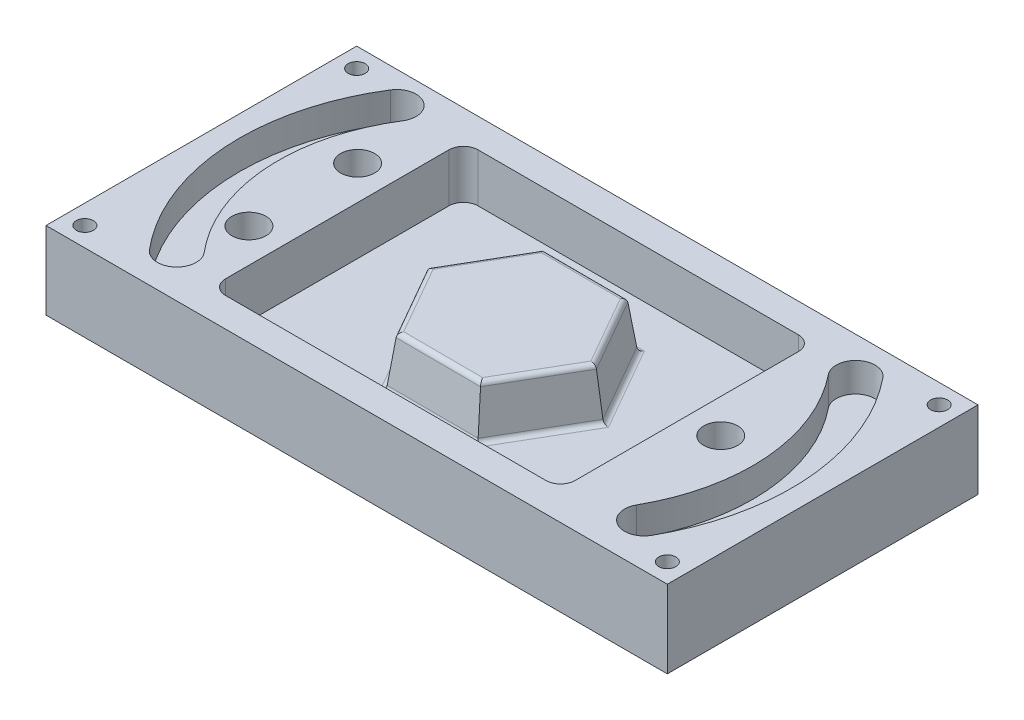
ISO-10303-21;
HEADER;
FILE_DESCRIPTION(('STEP AP214'),'2;1');
FILE_NAME('part.step','',(''),(''),'','','');
FILE_SCHEMA(('AUTOMOTIVE_DESIGN { 1 0 10303 214 1 1 1 1 }'));
ENDSEC;
DATA;
#1=APPLICATION_CONTEXT('core data for automotive mechanical design processes');
#2=APPLICATION_PROTOCOL_DEFINITION('international standard','automotive_design',2000,#1);
#3=PRODUCT_CONTEXT('',#1,'mechanical');
#4=PRODUCT('Part','Part','',(#3));
#5=PRODUCT_RELATED_PRODUCT_CATEGORY('part','',(#4));
#6=PRODUCT_DEFINITION_FORMATION('','',#4);
#7=PRODUCT_DEFINITION_CONTEXT('part definition',#1,'design');
#8=PRODUCT_DEFINITION('design','',#6,#7);
#9=PRODUCT_DEFINITION_SHAPE('','',#8);
#10=(LENGTH_UNIT() NAMED_UNIT(*) SI_UNIT(.MILLI.,.METRE.));
#11=(NAMED_UNIT(*) PLANE_ANGLE_UNIT() SI_UNIT($,.RADIAN.));
#12=(NAMED_UNIT(*) SI_UNIT($,.STERADIAN.) SOLID_ANGLE_UNIT());
#13=UNCERTAINTY_MEASURE_WITH_UNIT(LENGTH_MEASURE(1.E-05),#10,'distance_accuracy_value','');
#14=(GEOMETRIC_REPRESENTATION_CONTEXT(3) GLOBAL_UNCERTAINTY_ASSIGNED_CONTEXT((#13)) GLOBAL_UNIT_ASSIGNED_CONTEXT((#10,
#11,#12)) REPRESENTATION_CONTEXT('',''));
#15=CARTESIAN_POINT('',(0.,0.,0.));
#16=DIRECTION('',(0.,0.,1.));
#17=DIRECTION('',(1.,0.,0.));
#18=AXIS2_PLACEMENT_3D('',#15,#16,#17);
#19=CARTESIAN_POINT('',(-203.2,50.8,-101.6));
#20=DIRECTION('',(1.,0.,0.));
#21=DIRECTION('',(0.,0.,-1.));
#22=AXIS2_PLACEMENT_3D('',#19,#20,#21);
#23=PLANE('',#22);
#24=DIRECTION('',(0.,0.,1.));
#25=VECTOR('',#24,1.);
#26=CARTESIAN_POINT('',(-203.2,0.,-101.6));
#27=LINE('',#26,#25);
#28=CARTESIAN_POINT('',(-203.2,0.,-101.6));
#29=VERTEX_POINT('',#28);
#30=CARTESIAN_POINT('',(-203.2,0.,101.6));
#31=VERTEX_POINT('',#30);
#32=EDGE_CURVE('E589',#29,#31,#27,.T.);
#33=ORIENTED_EDGE('',*,*,#32,.T.);
#34=DIRECTION('',(0.,-1.,0.));
#35=VECTOR('',#34,1.);
#36=CARTESIAN_POINT('',(-203.2,50.8,101.6));
#37=LINE('',#36,#35);
#38=CARTESIAN_POINT('',(-203.2,50.8,101.6));
#39=VERTEX_POINT('',#38);
#40=EDGE_CURVE('E558',#39,#31,#37,.T.);
#41=ORIENTED_EDGE('',*,*,#40,.F.);
#42=DIRECTION('',(0.,0.,1.));
#43=VECTOR('',#42,1.);
#44=CARTESIAN_POINT('',(-203.2,50.8,-101.6));
#45=LINE('',#44,#43);
#46=CARTESIAN_POINT('',(-203.2,50.8,-101.6));
#47=VERTEX_POINT('',#46);
#48=EDGE_CURVE('E584',#47,#39,#45,.T.);
#49=ORIENTED_EDGE('',*,*,#48,.F.);
#50=DIRECTION('',(0.,-1.,0.));
#51=VECTOR('',#50,1.);
#52=CARTESIAN_POINT('',(-203.2,50.8,-101.6));
#53=LINE('',#52,#51);
#54=EDGE_CURVE('E578',#47,#29,#53,.T.);
#55=ORIENTED_EDGE('',*,*,#54,.T.);
#56=EDGE_LOOP('',(#33,#41,#49,#55));
#57=FACE_BOUND('',#56,.T.);
#58=ADVANCED_FACE('F46',(#57),#23,.F.);
#59=CARTESIAN_POINT('',(-203.2,50.8,101.6));
#60=DIRECTION('',(0.,0.,-1.));
#61=DIRECTION('',(-1.,0.,0.));
#62=AXIS2_PLACEMENT_3D('',#59,#60,#61);
#63=PLANE('',#62);
#64=DIRECTION('',(1.,0.,0.));
#65=VECTOR('',#64,1.);
#66=CARTESIAN_POINT('',(-203.2,0.,101.6));
#67=LINE('',#66,#65);
#68=CARTESIAN_POINT('',(203.2,0.,101.6));
#69=VERTEX_POINT('',#68);
#70=EDGE_CURVE('E587',#31,#69,#67,.T.);
#71=ORIENTED_EDGE('',*,*,#70,.T.);
#72=DIRECTION('',(0.,-1.,0.));
#73=VECTOR('',#72,1.);
#74=CARTESIAN_POINT('',(203.2,50.8,101.6));
#75=LINE('',#74,#73);
#76=CARTESIAN_POINT('',(203.2,50.8,101.6));
#77=VERTEX_POINT('',#76);
#78=EDGE_CURVE('E572',#77,#69,#75,.T.);
#79=ORIENTED_EDGE('',*,*,#78,.F.);
#80=DIRECTION('',(1.,0.,0.));
#81=VECTOR('',#80,1.);
#82=CARTESIAN_POINT('',(-203.2,50.8,101.6));
#83=LINE('',#82,#81);
#84=EDGE_CURVE('E596',#39,#77,#83,.T.);
#85=ORIENTED_EDGE('',*,*,#84,.F.);
#86=ORIENTED_EDGE('',*,*,#40,.T.);
#87=EDGE_LOOP('',(#71,#79,#85,#86));
#88=FACE_BOUND('',#87,.T.);
#89=ADVANCED_FACE('F648',(#88),#63,.F.);
#90=CARTESIAN_POINT('',(203.2,50.8,-101.6));
#91=DIRECTION('',(-1.,0.,0.));
#92=DIRECTION('',(0.,0.,1.));
#93=AXIS2_PLACEMENT_3D('',#90,#91,#92);
#94=PLANE('',#93);
#95=DIRECTION('',(0.,0.,-1.));
#96=VECTOR('',#95,1.);
#97=CARTESIAN_POINT('',(203.2,0.,-101.6));
#98=LINE('',#97,#96);
#99=CARTESIAN_POINT('',(203.2,0.,-101.6));
#100=VERTEX_POINT('',#99);
#101=EDGE_CURVE('E585',#69,#100,#98,.T.);
#102=ORIENTED_EDGE('',*,*,#101,.T.);
#103=DIRECTION('',(0.,-1.,0.));
#104=VECTOR('',#103,1.);
#105=CARTESIAN_POINT('',(203.2,50.8,-101.6));
#106=LINE('',#105,#104);
#107=CARTESIAN_POINT('',(203.2,50.8,-101.6));
#108=VERTEX_POINT('',#107);
#109=EDGE_CURVE('E575',#108,#100,#106,.T.);
#110=ORIENTED_EDGE('',*,*,#109,.F.);
#111=DIRECTION('',(0.,0.,-1.));
#112=VECTOR('',#111,1.);
#113=CARTESIAN_POINT('',(203.2,50.8,-101.6));
#114=LINE('',#113,#112);
#115=EDGE_CURVE('E594',#77,#108,#114,.T.);
#116=ORIENTED_EDGE('',*,*,#115,.F.);
#117=ORIENTED_EDGE('',*,*,#78,.T.);
#118=EDGE_LOOP('',(#102,#110,#116,#117));
#119=FACE_BOUND('',#118,.T.);
#120=ADVANCED_FACE('F653',(#119),#94,.F.);
#121=CARTESIAN_POINT('',(-203.2,50.8,-101.6));
#122=DIRECTION('',(0.,0.,1.));
#123=DIRECTION('',(1.,0.,0.));
#124=AXIS2_PLACEMENT_3D('',#121,#122,#123);
#125=PLANE('',#124);
#126=DIRECTION('',(-1.,0.,0.));
#127=VECTOR('',#126,1.);
#128=CARTESIAN_POINT('',(-203.2,0.,-101.6));
#129=LINE('',#128,#127);
#130=EDGE_CURVE('E582',#100,#29,#129,.T.);
#131=ORIENTED_EDGE('',*,*,#130,.T.);
#132=ORIENTED_EDGE('',*,*,#54,.F.);
#133=DIRECTION('',(-1.,0.,0.));
#134=VECTOR('',#133,1.);
#135=CARTESIAN_POINT('',(-203.2,50.8,-101.6));
#136=LINE('',#135,#134);
#137=EDGE_CURVE('E581',#108,#47,#136,.T.);
#138=ORIENTED_EDGE('',*,*,#137,.F.);
#139=ORIENTED_EDGE('',*,*,#109,.T.);
#140=EDGE_LOOP('',(#131,#132,#138,#139));
#141=FACE_BOUND('',#140,.T.);
#142=ADVANCED_FACE('F805',(#141),#125,.F.);
#143=CARTESIAN_POINT('',(-203.2,50.8,101.6));
#144=DIRECTION('',(0.,1.,0.));
#145=DIRECTION('',(0.,0.,1.));
#146=AXIS2_PLACEMENT_3D('',#143,#144,#145);
#147=PLANE('',#146);
#148=CARTESIAN_POINT('',(136.525,50.8,0.));
#149=DIRECTION('',(0.,1.,0.));
#150=DIRECTION('',(0.,0.,1.));
#151=AXIS2_PLACEMENT_3D('',#148,#149,#150);
#152=CIRCLE('',#151,11.1125);
#153=CARTESIAN_POINT('',(136.525,50.8,11.1125));
#154=VERTEX_POINT('',#153);
#155=EDGE_CURVE('E333',#154,#154,#152,.T.);
#156=ORIENTED_EDGE('',*,*,#155,.F.);
#157=EDGE_LOOP('',(#156));
#158=FACE_BOUND('',#157,.T.);
#159=CARTESIAN_POINT('',(-136.525,50.8,35.56));
#160=DIRECTION('',(0.,1.,0.));
#161=DIRECTION('',(0.,0.,1.));
#162=AXIS2_PLACEMENT_3D('',#159,#160,#161);
#163=CIRCLE('',#162,11.1125);
#164=CARTESIAN_POINT('',(-136.525,50.8,46.6725));
#165=VERTEX_POINT('',#164);
#166=EDGE_CURVE('E344',#165,#165,#163,.T.);
#167=ORIENTED_EDGE('',*,*,#166,.F.);
#168=EDGE_LOOP('',(#167));
#169=FACE_BOUND('',#168,.T.);
#170=CARTESIAN_POINT('',(-136.525,50.8,-35.56));
#171=DIRECTION('',(0.,1.,0.));
#172=DIRECTION('',(0.,0.,1.));
#173=AXIS2_PLACEMENT_3D('',#170,#171,#172);
#174=CIRCLE('',#173,11.1125);
#175=CARTESIAN_POINT('',(-136.525,50.8,-24.4475));
#176=VERTEX_POINT('',#175);
#177=EDGE_CURVE('E343',#176,#176,#174,.T.);
#178=ORIENTED_EDGE('',*,*,#177,.F.);
#179=EDGE_LOOP('',(#178));
#180=FACE_BOUND('',#179,.T.);
#181=CARTESIAN_POINT('',(190.5,50.8,-88.9));
#182=DIRECTION('',(0.,1.,0.));
#183=DIRECTION('',(0.,0.,1.));
#184=AXIS2_PLACEMENT_3D('',#181,#182,#183);
#185=CIRCLE('',#184,5.55625000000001);
#186=CARTESIAN_POINT('',(190.5,50.8,-83.34375));
#187=VERTEX_POINT('',#186);
#188=EDGE_CURVE('E362',#187,#187,#185,.T.);
#189=ORIENTED_EDGE('',*,*,#188,.F.);
#190=EDGE_LOOP('',(#189));
#191=FACE_BOUND('',#190,.T.);
#192=CARTESIAN_POINT('',(190.5,50.8,88.9));
#193=DIRECTION('',(0.,1.,0.));
#194=DIRECTION('',(0.,0.,1.));
#195=AXIS2_PLACEMENT_3D('',#192,#193,#194);
#196=CIRCLE('',#195,5.55625000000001);
#197=CARTESIAN_POINT('',(190.5,50.8,94.45625));
#198=VERTEX_POINT('',#197);
#199=EDGE_CURVE('E361',#198,#198,#196,.T.);
#200=ORIENTED_EDGE('',*,*,#199,.F.);
#201=EDGE_LOOP('',(#200));
#202=FACE_BOUND('',#201,.T.);
#203=CARTESIAN_POINT('',(-190.5,50.8,88.9));
#204=DIRECTION('',(0.,1.,0.));
#205=DIRECTION('',(0.,0.,1.));
#206=AXIS2_PLACEMENT_3D('',#203,#204,#205);
#207=CIRCLE('',#206,5.55625000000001);
#208=CARTESIAN_POINT('',(-190.5,50.8,94.45625));
#209=VERTEX_POINT('',#208);
#210=EDGE_CURVE('E380',#209,#209,#207,.T.);
#211=ORIENTED_EDGE('',*,*,#210,.F.);
#212=EDGE_LOOP('',(#211));
#213=FACE_BOUND('',#212,.T.);
#214=CARTESIAN_POINT('',(-190.5,50.8,-88.9));
#215=DIRECTION('',(0.,1.,0.));
#216=DIRECTION('',(0.,0.,1.));
#217=AXIS2_PLACEMENT_3D('',#214,#215,#216);
#218=CIRCLE('',#217,5.55625000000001);
#219=CARTESIAN_POINT('',(-190.5,50.8,-83.34375));
#220=VERTEX_POINT('',#219);
#221=EDGE_CURVE('E379',#220,#220,#218,.T.);
#222=ORIENTED_EDGE('',*,*,#221,.F.);
#223=EDGE_LOOP('',(#222));
#224=FACE_BOUND('',#223,.T.);
#225=DIRECTION('',(0.,0.,1.));
#226=VECTOR('',#225,1.);
#227=CARTESIAN_POINT('',(-114.3,50.8,-82.55));
#228=LINE('',#227,#226);
#229=CARTESIAN_POINT('',(-114.3,50.8,-73.025));
#230=VERTEX_POINT('',#229);
#231=CARTESIAN_POINT('',(-114.3,50.8,73.025));
#232=VERTEX_POINT('',#231);
#233=EDGE_CURVE('E404',#230,#232,#228,.T.);
#234=ORIENTED_EDGE('',*,*,#233,.F.);
#235=CARTESIAN_POINT('',(-104.775,50.8,-73.025));
#236=DIRECTION('',(0.,1.,0.));
#237=DIRECTION('',(0.,0.,1.));
#238=AXIS2_PLACEMENT_3D('',#235,#236,#237);
#239=CIRCLE('',#238,9.525);
#240=CARTESIAN_POINT('',(-104.775,50.8,-82.55));
#241=VERTEX_POINT('',#240);
#242=EDGE_CURVE('E12',#230,#241,#239,.F.);
#243=ORIENTED_EDGE('',*,*,#242,.T.);
#244=DIRECTION('',(-1.,0.,0.));
#245=VECTOR('',#244,1.);
#246=CARTESIAN_POINT('',(-114.3,50.8,-82.55));
#247=LINE('',#246,#245);
#248=CARTESIAN_POINT('',(104.775,50.8,-82.55));
#249=VERTEX_POINT('',#248);
#250=EDGE_CURVE('E285',#249,#241,#247,.T.);
#251=ORIENTED_EDGE('',*,*,#250,.F.);
#252=CARTESIAN_POINT('',(104.775,50.8,-73.025));
#253=DIRECTION('',(0.,1.,0.));
#254=DIRECTION('',(0.,0.,1.));
#255=AXIS2_PLACEMENT_3D('',#252,#253,#254);
#256=CIRCLE('',#255,9.525);
#257=CARTESIAN_POINT('',(114.3,50.8,-73.025));
#258=VERTEX_POINT('',#257);
#259=EDGE_CURVE('E54',#249,#258,#256,.F.);
#260=ORIENTED_EDGE('',*,*,#259,.T.);
#261=DIRECTION('',(0.,0.,-1.));
#262=VECTOR('',#261,1.);
#263=CARTESIAN_POINT('',(114.3,50.8,-82.55));
#264=LINE('',#263,#262);
#265=CARTESIAN_POINT('',(114.3,50.8,73.025));
#266=VERTEX_POINT('',#265);
#267=EDGE_CURVE('E412',#266,#258,#264,.T.);
#268=ORIENTED_EDGE('',*,*,#267,.F.);
#269=CARTESIAN_POINT('',(104.775,50.8,73.025));
#270=DIRECTION('',(0.,1.,0.));
#271=DIRECTION('',(0.,0.,1.));
#272=AXIS2_PLACEMENT_3D('',#269,#270,#271);
#273=CIRCLE('',#272,9.525);
#274=CARTESIAN_POINT('',(104.775,50.8,82.55));
#275=VERTEX_POINT('',#274);
#276=EDGE_CURVE('E439',#266,#275,#273,.F.);
#277=ORIENTED_EDGE('',*,*,#276,.T.);
#278=DIRECTION('',(1.,0.,0.));
#279=VECTOR('',#278,1.);
#280=CARTESIAN_POINT('',(-114.3,50.8,82.55));
#281=LINE('',#280,#279);
#282=CARTESIAN_POINT('',(-104.775,50.8,82.55));
#283=VERTEX_POINT('',#282);
#284=EDGE_CURVE('E409',#283,#275,#281,.T.);
#285=ORIENTED_EDGE('',*,*,#284,.F.);
#286=CARTESIAN_POINT('',(-104.775,50.8,73.025));
#287=DIRECTION('',(0.,1.,0.));
#288=DIRECTION('',(0.,0.,1.));
#289=AXIS2_PLACEMENT_3D('',#286,#287,#288);
#290=CIRCLE('',#289,9.525);
#291=EDGE_CURVE('E437',#283,#232,#290,.F.);
#292=ORIENTED_EDGE('',*,*,#291,.T.);
#293=EDGE_LOOP('',(#234,#243,#251,#260,#268,#277,#285,#292));
#294=FACE_BOUND('',#293,.T.);
#295=CARTESIAN_POINT('',(159.293480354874,50.8,72.9363454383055));
#296=DIRECTION('',(0.,1.,0.));
#297=DIRECTION('',(0.,0.,1.));
#298=AXIS2_PLACEMENT_3D('',#295,#296,#297);
#299=CIRCLE('',#298,12.7);
#300=CARTESIAN_POINT('',(148.240515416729,50.8,66.6815899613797));
#301=VERTEX_POINT('',#300);
#302=CARTESIAN_POINT('',(170.346445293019,50.8,79.1911009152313));
#303=VERTEX_POINT('',#302);
#304=EDGE_CURVE('E261',#301,#303,#299,.T.);
#305=ORIENTED_EDGE('',*,*,#304,.F.);
#306=CARTESIAN_POINT('',(42.1486498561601,50.8,6.64532992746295));
#307=DIRECTION('',(0.,-1.,0.));
#308=DIRECTION('',(0.,0.,1.));
#309=AXIS2_PLACEMENT_3D('',#306,#307,#308);
#310=CIRCLE('',#309,121.90092886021);
#311=CARTESIAN_POINT('',(137.0989541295,50.8,-69.802535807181));
#312=VERTEX_POINT('',#311);
#313=EDGE_CURVE('E278',#312,#301,#310,.T.);
#314=ORIENTED_EDGE('',*,*,#313,.F.);
#315=CARTESIAN_POINT('',(146.991158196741,50.8,-77.7671009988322));
#316=DIRECTION('',(0.,1.,0.));
#317=DIRECTION('',(0.,0.,1.));
#318=AXIS2_PLACEMENT_3D('',#315,#316,#317);
#319=CIRCLE('',#318,12.7);
#320=CARTESIAN_POINT('',(156.883362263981,50.8,-85.7316661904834));
#321=VERTEX_POINT('',#320);
#322=EDGE_CURVE('E281',#321,#312,#319,.T.);
#323=ORIENTED_EDGE('',*,*,#322,.F.);
#324=CARTESIAN_POINT('',(42.1486498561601,50.8,6.64532992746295));
#325=DIRECTION('',(0.,1.,0.));
#326=DIRECTION('',(0.,0.,1.));
#327=AXIS2_PLACEMENT_3D('',#324,#325,#326);
#328=CIRCLE('',#327,147.30092886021);
#329=EDGE_CURVE('E302',#303,#321,#328,.T.);
#330=ORIENTED_EDGE('',*,*,#329,.F.);
#331=EDGE_LOOP('',(#305,#314,#323,#330));
#332=FACE_BOUND('',#331,.T.);
#333=CARTESIAN_POINT('',(-156.571598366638,50.8,-81.1367672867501));
#334=DIRECTION('',(0.,1.,0.));
#335=DIRECTION('',(0.,0.,1.));
#336=AXIS2_PLACEMENT_3D('',#333,#334,#335);
#337=CIRCLE('',#336,12.7);
#338=CARTESIAN_POINT('',(-145.824758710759,50.8,-74.369534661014));
#339=VERTEX_POINT('',#338);
#340=CARTESIAN_POINT('',(-167.318438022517,50.8,-87.9039999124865));
#341=VERTEX_POINT('',#340);
#342=EDGE_CURVE('E627',#339,#341,#337,.T.);
#343=ORIENTED_EDGE('',*,*,#342,.F.);
#344=CARTESIAN_POINT('',(-45.5190012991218,50.8,-11.2074874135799));
#345=DIRECTION('',(0.,-1.,0.));
#346=DIRECTION('',(0.,0.,1.));
#347=AXIS2_PLACEMENT_3D('',#344,#345,#346);
#348=CIRCLE('',#347,118.53560301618);
#349=CARTESIAN_POINT('',(-136.140165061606,50.8,65.2025502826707));
#350=VERTEX_POINT('',#349);
#351=EDGE_CURVE('E608',#350,#339,#348,.T.);
#352=ORIENTED_EDGE('',*,*,#351,.F.);
#353=CARTESIAN_POINT('',(-145.849389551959,50.8,73.3891832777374));
#354=DIRECTION('',(0.,1.,0.));
#355=DIRECTION('',(0.,0.,1.));
#356=AXIS2_PLACEMENT_3D('',#353,#354,#355);
#357=CIRCLE('',#356,12.7);
#358=CARTESIAN_POINT('',(-155.558614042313,50.8,81.575816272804));
#359=VERTEX_POINT('',#358);
#360=EDGE_CURVE('E612',#359,#350,#357,.T.);
#361=ORIENTED_EDGE('',*,*,#360,.F.);
#362=CARTESIAN_POINT('',(-45.5190012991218,50.8,-11.2074874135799));
#363=DIRECTION('',(0.,1.,0.));
#364=DIRECTION('',(0.,0.,1.));
#365=AXIS2_PLACEMENT_3D('',#362,#363,#364);
#366=CIRCLE('',#365,143.93560301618);
#367=EDGE_CURVE('E1188',#341,#359,#366,.T.);
#368=ORIENTED_EDGE('',*,*,#367,.F.);
#369=EDGE_LOOP('',(#343,#352,#361,#368));
#370=FACE_BOUND('',#369,.T.);
#371=ORIENTED_EDGE('',*,*,#48,.T.);
#372=ORIENTED_EDGE('',*,*,#84,.T.);
#373=ORIENTED_EDGE('',*,*,#115,.T.);
#374=ORIENTED_EDGE('',*,*,#137,.T.);
#375=EDGE_LOOP('',(#371,#372,#373,#374));
#376=FACE_BOUND('',#375,.T.);
#377=ADVANCED_FACE('F442',(#158,#169,#180,#191,#202,#213,#224,#294,#332,#370,#376),#147,.T.);
#378=CARTESIAN_POINT('',(-203.2,0.,101.6));
#379=DIRECTION('',(0.,1.,0.));
#380=DIRECTION('',(0.,0.,1.));
#381=AXIS2_PLACEMENT_3D('',#378,#379,#380);
#382=PLANE('',#381);
#383=CARTESIAN_POINT('',(136.525,0.,0.));
#384=DIRECTION('',(0.,1.,0.));
#385=DIRECTION('',(0.,0.,1.));
#386=AXIS2_PLACEMENT_3D('',#383,#384,#385);
#387=CIRCLE('',#386,11.1125);
#388=CARTESIAN_POINT('',(136.525,0.,11.1125));
#389=VERTEX_POINT('',#388);
#390=EDGE_CURVE('E337',#389,#389,#387,.T.);
#391=ORIENTED_EDGE('',*,*,#390,.T.);
#392=EDGE_LOOP('',(#391));
#393=FACE_BOUND('',#392,.T.);
#394=CARTESIAN_POINT('',(-136.525,0.,35.56));
#395=DIRECTION('',(0.,1.,0.));
#396=DIRECTION('',(0.,0.,1.));
#397=AXIS2_PLACEMENT_3D('',#394,#395,#396);
#398=CIRCLE('',#397,11.1125);
#399=CARTESIAN_POINT('',(-136.525,0.,46.6725));
#400=VERTEX_POINT('',#399);
#401=EDGE_CURVE('E339',#400,#400,#398,.T.);
#402=ORIENTED_EDGE('',*,*,#401,.T.);
#403=EDGE_LOOP('',(#402));
#404=FACE_BOUND('',#403,.T.);
#405=CARTESIAN_POINT('',(-136.525,0.,-35.56));
#406=DIRECTION('',(0.,1.,0.));
#407=DIRECTION('',(0.,0.,1.));
#408=AXIS2_PLACEMENT_3D('',#405,#406,#407);
#409=CIRCLE('',#408,11.1125);
#410=CARTESIAN_POINT('',(-136.525,0.,-24.4475));
#411=VERTEX_POINT('',#410);
#412=EDGE_CURVE('E355',#411,#411,#409,.T.);
#413=ORIENTED_EDGE('',*,*,#412,.T.);
#414=EDGE_LOOP('',(#413));
#415=FACE_BOUND('',#414,.T.);
#416=CARTESIAN_POINT('',(190.5,0.,-88.9));
#417=DIRECTION('',(0.,1.,0.));
#418=DIRECTION('',(0.,0.,1.));
#419=AXIS2_PLACEMENT_3D('',#416,#417,#418);
#420=CIRCLE('',#419,5.55625000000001);
#421=CARTESIAN_POINT('',(190.5,0.,-83.34375));
#422=VERTEX_POINT('',#421);
#423=EDGE_CURVE('E357',#422,#422,#420,.T.);
#424=ORIENTED_EDGE('',*,*,#423,.T.);
#425=EDGE_LOOP('',(#424));
#426=FACE_BOUND('',#425,.T.);
#427=CARTESIAN_POINT('',(190.5,0.,88.9));
#428=DIRECTION('',(0.,1.,0.));
#429=DIRECTION('',(0.,0.,1.));
#430=AXIS2_PLACEMENT_3D('',#427,#428,#429);
#431=CIRCLE('',#430,5.55625000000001);
#432=CARTESIAN_POINT('',(190.5,0.,94.45625));
#433=VERTEX_POINT('',#432);
#434=EDGE_CURVE('E373',#433,#433,#431,.T.);
#435=ORIENTED_EDGE('',*,*,#434,.T.);
#436=EDGE_LOOP('',(#435));
#437=FACE_BOUND('',#436,.T.);
#438=CARTESIAN_POINT('',(-190.5,0.,88.9));
#439=DIRECTION('',(0.,1.,0.));
#440=DIRECTION('',(0.,0.,1.));
#441=AXIS2_PLACEMENT_3D('',#438,#439,#440);
#442=CIRCLE('',#441,5.55625000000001);
#443=CARTESIAN_POINT('',(-190.5,0.,94.45625));
#444=VERTEX_POINT('',#443);
#445=EDGE_CURVE('E375',#444,#444,#442,.T.);
#446=ORIENTED_EDGE('',*,*,#445,.T.);
#447=EDGE_LOOP('',(#446));
#448=FACE_BOUND('',#447,.T.);
#449=CARTESIAN_POINT('',(-190.5,0.,-88.9));
#450=DIRECTION('',(0.,1.,0.));
#451=DIRECTION('',(0.,0.,1.));
#452=AXIS2_PLACEMENT_3D('',#449,#450,#451);
#453=CIRCLE('',#452,5.55625000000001);
#454=CARTESIAN_POINT('',(-190.5,0.,-83.34375));
#455=VERTEX_POINT('',#454);
#456=EDGE_CURVE('E391',#455,#455,#453,.T.);
#457=ORIENTED_EDGE('',*,*,#456,.T.);
#458=EDGE_LOOP('',(#457));
#459=FACE_BOUND('',#458,.T.);
#460=ORIENTED_EDGE('',*,*,#32,.F.);
#461=ORIENTED_EDGE('',*,*,#130,.F.);
#462=ORIENTED_EDGE('',*,*,#101,.F.);
#463=ORIENTED_EDGE('',*,*,#70,.F.);
#464=EDGE_LOOP('',(#460,#461,#462,#463));
#465=FACE_BOUND('',#464,.T.);
#466=ADVANCED_FACE('F801',(#393,#404,#415,#426,#437,#448,#459,#465),#382,.F.);
#467=CARTESIAN_POINT('',(-156.571598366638,31.75,-81.1367672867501));
#468=DIRECTION('',(0.,1.,0.));
#469=DIRECTION('',(0.,0.,1.));
#470=AXIS2_PLACEMENT_3D('',#467,#468,#469);
#471=CYLINDRICAL_SURFACE('',#470,12.7);
#472=ORIENTED_EDGE('',*,*,#342,.T.);
#473=DIRECTION('',(0.,1.,0.));
#474=VECTOR('',#473,1.);
#475=CARTESIAN_POINT('',(-167.318438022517,31.75,-87.9039999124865));
#476=LINE('',#475,#474);
#477=CARTESIAN_POINT('',(-167.318438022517,31.75,-87.9039999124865));
#478=VERTEX_POINT('',#477);
#479=EDGE_CURVE('E600',#478,#341,#476,.T.);
#480=ORIENTED_EDGE('',*,*,#479,.F.);
#481=CARTESIAN_POINT('',(-156.571598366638,31.75,-81.1367672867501));
#482=DIRECTION('',(0.,1.,0.));
#483=DIRECTION('',(0.,0.,1.));
#484=AXIS2_PLACEMENT_3D('',#481,#482,#483);
#485=CIRCLE('',#484,12.7);
#486=CARTESIAN_POINT('',(-145.824758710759,31.75,-74.369534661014));
#487=VERTEX_POINT('',#486);
#488=EDGE_CURVE('E320',#487,#478,#485,.T.);
#489=ORIENTED_EDGE('',*,*,#488,.F.);
#490=DIRECTION('',(0.,1.,0.));
#491=VECTOR('',#490,1.);
#492=CARTESIAN_POINT('',(-145.824758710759,31.75,-74.369534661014));
#493=LINE('',#492,#491);
#494=EDGE_CURVE('E592',#487,#339,#493,.T.);
#495=ORIENTED_EDGE('',*,*,#494,.T.);
#496=EDGE_LOOP('',(#472,#480,#489,#495));
#497=FACE_BOUND('',#496,.T.);
#498=ADVANCED_FACE('F791',(#497),#471,.F.);
#499=CARTESIAN_POINT('',(-45.5190012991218,31.75,-11.2074874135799));
#500=DIRECTION('',(0.,1.,0.));
#501=DIRECTION('',(0.,0.,1.));
#502=AXIS2_PLACEMENT_3D('',#499,#500,#501);
#503=CYLINDRICAL_SURFACE('',#502,118.53560301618);
#504=ORIENTED_EDGE('',*,*,#351,.T.);
#505=ORIENTED_EDGE('',*,*,#494,.F.);
#506=CARTESIAN_POINT('',(-45.5190012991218,31.75,-11.2074874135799));
#507=DIRECTION('',(0.,-1.,0.));
#508=DIRECTION('',(0.,0.,1.));
#509=AXIS2_PLACEMENT_3D('',#506,#507,#508);
#510=CIRCLE('',#509,118.53560301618);
#511=CARTESIAN_POINT('',(-136.140165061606,31.75,65.2025502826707));
#512=VERTEX_POINT('',#511);
#513=EDGE_CURVE('E324',#512,#487,#510,.T.);
#514=ORIENTED_EDGE('',*,*,#513,.F.);
#515=DIRECTION('',(0.,1.,0.));
#516=VECTOR('',#515,1.);
#517=CARTESIAN_POINT('',(-136.140165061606,31.75,65.2025502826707));
#518=LINE('',#517,#516);
#519=EDGE_CURVE('E605',#512,#350,#518,.T.);
#520=ORIENTED_EDGE('',*,*,#519,.T.);
#521=EDGE_LOOP('',(#504,#505,#514,#520));
#522=FACE_BOUND('',#521,.T.);
#523=ADVANCED_FACE('F787',(#522),#503,.T.);
#524=CARTESIAN_POINT('',(-145.849389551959,31.75,73.3891832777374));
#525=DIRECTION('',(0.,1.,0.));
#526=DIRECTION('',(0.,0.,1.));
#527=AXIS2_PLACEMENT_3D('',#524,#525,#526);
#528=CYLINDRICAL_SURFACE('',#527,12.7);
#529=ORIENTED_EDGE('',*,*,#360,.T.);
#530=ORIENTED_EDGE('',*,*,#519,.F.);
#531=CARTESIAN_POINT('',(-145.849389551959,31.75,73.3891832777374));
#532=DIRECTION('',(0.,1.,0.));
#533=DIRECTION('',(0.,0.,1.));
#534=AXIS2_PLACEMENT_3D('',#531,#532,#533);
#535=CIRCLE('',#534,12.7);
#536=CARTESIAN_POINT('',(-155.558614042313,31.75,81.575816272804));
#537=VERTEX_POINT('',#536);
#538=EDGE_CURVE('E319',#537,#512,#535,.T.);
#539=ORIENTED_EDGE('',*,*,#538,.F.);
#540=DIRECTION('',(0.,1.,0.));
#541=VECTOR('',#540,1.);
#542=CARTESIAN_POINT('',(-155.558614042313,31.75,81.575816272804));
#543=LINE('',#542,#541);
#544=EDGE_CURVE('E603',#537,#359,#543,.T.);
#545=ORIENTED_EDGE('',*,*,#544,.T.);
#546=EDGE_LOOP('',(#529,#530,#539,#545));
#547=FACE_BOUND('',#546,.T.);
#548=ADVANCED_FACE('F790',(#547),#528,.F.);
#549=CARTESIAN_POINT('',(-45.5190012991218,31.75,-11.2074874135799));
#550=DIRECTION('',(0.,1.,0.));
#551=DIRECTION('',(0.,0.,1.));
#552=AXIS2_PLACEMENT_3D('',#549,#550,#551);
#553=CYLINDRICAL_SURFACE('',#552,143.93560301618);
#554=ORIENTED_EDGE('',*,*,#367,.T.);
#555=ORIENTED_EDGE('',*,*,#544,.F.);
#556=CARTESIAN_POINT('',(-45.5190012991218,31.75,-11.2074874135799));
#557=DIRECTION('',(0.,1.,0.));
#558=DIRECTION('',(0.,0.,1.));
#559=AXIS2_PLACEMENT_3D('',#556,#557,#558);
#560=CIRCLE('',#559,143.93560301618);
#561=EDGE_CURVE('E314',#478,#537,#560,.T.);
#562=ORIENTED_EDGE('',*,*,#561,.F.);
#563=ORIENTED_EDGE('',*,*,#479,.T.);
#564=EDGE_LOOP('',(#554,#555,#562,#563));
#565=FACE_BOUND('',#564,.T.);
#566=ADVANCED_FACE('F785',(#565),#553,.F.);
#567=CARTESIAN_POINT('',(-101.04529983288,31.75,-46.172127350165));
#568=DIRECTION('',(0.,1.,0.));
#569=DIRECTION('',(0.,0.,1.));
#570=AXIS2_PLACEMENT_3D('',#567,#568,#569);
#571=PLANE('',#570);
#572=ORIENTED_EDGE('',*,*,#488,.T.);
#573=ORIENTED_EDGE('',*,*,#561,.T.);
#574=ORIENTED_EDGE('',*,*,#538,.T.);
#575=ORIENTED_EDGE('',*,*,#513,.T.);
#576=EDGE_LOOP('',(#572,#573,#574,#575));
#577=FACE_BOUND('',#576,.T.);
#578=ADVANCED_FACE('F644',(#577),#571,.T.);
#579=CARTESIAN_POINT('',(159.293480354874,31.75,72.9363454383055));
#580=DIRECTION('',(0.,1.,0.));
#581=DIRECTION('',(0.,0.,1.));
#582=AXIS2_PLACEMENT_3D('',#579,#580,#581);
#583=CYLINDRICAL_SURFACE('',#582,12.7);
#584=ORIENTED_EDGE('',*,*,#304,.T.);
#585=DIRECTION('',(0.,1.,0.));
#586=VECTOR('',#585,1.);
#587=CARTESIAN_POINT('',(170.346445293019,31.75,79.1911009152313));
#588=LINE('',#587,#586);
#589=CARTESIAN_POINT('',(170.346445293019,31.75,79.1911009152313));
#590=VERTEX_POINT('',#589);
#591=EDGE_CURVE('E254',#590,#303,#588,.T.);
#592=ORIENTED_EDGE('',*,*,#591,.F.);
#593=CARTESIAN_POINT('',(159.293480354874,31.75,72.9363454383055));
#594=DIRECTION('',(0.,1.,0.));
#595=DIRECTION('',(0.,0.,1.));
#596=AXIS2_PLACEMENT_3D('',#593,#594,#595);
#597=CIRCLE('',#596,12.7);
#598=CARTESIAN_POINT('',(148.240515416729,31.75,66.6815899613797));
#599=VERTEX_POINT('',#598);
#600=EDGE_CURVE('E258',#599,#590,#597,.T.);
#601=ORIENTED_EDGE('',*,*,#600,.F.);
#602=DIRECTION('',(0.,1.,0.));
#603=VECTOR('',#602,1.);
#604=CARTESIAN_POINT('',(148.240515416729,31.75,66.6815899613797));
#605=LINE('',#604,#603);
#606=EDGE_CURVE('E625',#599,#301,#605,.T.);
#607=ORIENTED_EDGE('',*,*,#606,.T.);
#608=EDGE_LOOP('',(#584,#592,#601,#607));
#609=FACE_BOUND('',#608,.T.);
#610=ADVANCED_FACE('F256',(#609),#583,.F.);
#611=CARTESIAN_POINT('',(42.1486498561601,31.75,6.64532992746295));
#612=DIRECTION('',(0.,1.,0.));
#613=DIRECTION('',(0.,0.,1.));
#614=AXIS2_PLACEMENT_3D('',#611,#612,#613);
#615=CYLINDRICAL_SURFACE('',#614,121.90092886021);
#616=ORIENTED_EDGE('',*,*,#313,.T.);
#617=ORIENTED_EDGE('',*,*,#606,.F.);
#618=CARTESIAN_POINT('',(42.1486498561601,31.75,6.64532992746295));
#619=DIRECTION('',(0.,-1.,0.));
#620=DIRECTION('',(0.,0.,1.));
#621=AXIS2_PLACEMENT_3D('',#618,#619,#620);
#622=CIRCLE('',#621,121.90092886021);
#623=CARTESIAN_POINT('',(137.0989541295,31.75,-69.802535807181));
#624=VERTEX_POINT('',#623);
#625=EDGE_CURVE('E266',#624,#599,#622,.T.);
#626=ORIENTED_EDGE('',*,*,#625,.F.);
#627=DIRECTION('',(0.,1.,0.));
#628=VECTOR('',#627,1.);
#629=CARTESIAN_POINT('',(137.0989541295,31.75,-69.802535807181));
#630=LINE('',#629,#628);
#631=EDGE_CURVE('E628',#624,#312,#630,.T.);
#632=ORIENTED_EDGE('',*,*,#631,.T.);
#633=EDGE_LOOP('',(#616,#617,#626,#632));
#634=FACE_BOUND('',#633,.T.);
#635=ADVANCED_FACE('F637',(#634),#615,.T.);
#636=CARTESIAN_POINT('',(146.991158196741,31.75,-77.7671009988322));
#637=DIRECTION('',(0.,1.,0.));
#638=DIRECTION('',(0.,0.,1.));
#639=AXIS2_PLACEMENT_3D('',#636,#637,#638);
#640=CYLINDRICAL_SURFACE('',#639,12.7);
#641=ORIENTED_EDGE('',*,*,#322,.T.);
#642=ORIENTED_EDGE('',*,*,#631,.F.);
#643=CARTESIAN_POINT('',(146.991158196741,31.75,-77.7671009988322));
#644=DIRECTION('',(0.,1.,0.));
#645=DIRECTION('',(0.,0.,1.));
#646=AXIS2_PLACEMENT_3D('',#643,#644,#645);
#647=CIRCLE('',#646,12.7);
#648=CARTESIAN_POINT('',(156.883362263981,31.75,-85.7316661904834));
#649=VERTEX_POINT('',#648);
#650=EDGE_CURVE('E274',#649,#624,#647,.T.);
#651=ORIENTED_EDGE('',*,*,#650,.F.);
#652=DIRECTION('',(0.,1.,0.));
#653=VECTOR('',#652,1.);
#654=CARTESIAN_POINT('',(156.883362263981,31.75,-85.7316661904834));
#655=LINE('',#654,#653);
#656=EDGE_CURVE('E265',#649,#321,#655,.T.);
#657=ORIENTED_EDGE('',*,*,#656,.T.);
#658=EDGE_LOOP('',(#641,#642,#651,#657));
#659=FACE_BOUND('',#658,.T.);
#660=ADVANCED_FACE('F632',(#659),#640,.F.);
#661=CARTESIAN_POINT('',(42.1486498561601,31.75,6.64532992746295));
#662=DIRECTION('',(0.,1.,0.));
#663=DIRECTION('',(0.,0.,1.));
#664=AXIS2_PLACEMENT_3D('',#661,#662,#663);
#665=CYLINDRICAL_SURFACE('',#664,147.30092886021);
#666=ORIENTED_EDGE('',*,*,#329,.T.);
#667=ORIENTED_EDGE('',*,*,#656,.F.);
#668=CARTESIAN_POINT('',(42.1486498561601,31.75,6.64532992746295));
#669=DIRECTION('',(0.,1.,0.));
#670=DIRECTION('',(0.,0.,1.));
#671=AXIS2_PLACEMENT_3D('',#668,#669,#670);
#672=CIRCLE('',#671,147.30092886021);
#673=EDGE_CURVE('E269',#590,#649,#672,.T.);
#674=ORIENTED_EDGE('',*,*,#673,.F.);
#675=ORIENTED_EDGE('',*,*,#591,.T.);
#676=EDGE_LOOP('',(#666,#667,#674,#675));
#677=FACE_BOUND('',#676,.T.);
#678=ADVANCED_FACE('F270',(#677),#665,.F.);
#679=CARTESIAN_POINT('',(100.721065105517,31.75,39.7908376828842));
#680=DIRECTION('',(0.,1.,0.));
#681=DIRECTION('',(0.,0.,1.));
#682=AXIS2_PLACEMENT_3D('',#679,#680,#681);
#683=PLANE('',#682);
#684=ORIENTED_EDGE('',*,*,#600,.T.);
#685=ORIENTED_EDGE('',*,*,#673,.T.);
#686=ORIENTED_EDGE('',*,*,#650,.T.);
#687=ORIENTED_EDGE('',*,*,#625,.T.);
#688=EDGE_LOOP('',(#684,#685,#686,#687));
#689=FACE_BOUND('',#688,.T.);
#690=ADVANCED_FACE('F276',(#689),#683,.T.);
#691=CARTESIAN_POINT('',(-114.3,19.05,-82.55));
#692=DIRECTION('',(-1.,0.,0.));
#693=DIRECTION('',(0.,0.,1.));
#694=AXIS2_PLACEMENT_3D('',#691,#692,#693);
#695=PLANE('',#694);
#696=ORIENTED_EDGE('',*,*,#233,.T.);
#697=DIRECTION('',(0.,1.,0.));
#698=VECTOR('',#697,1.);
#699=CARTESIAN_POINT('',(-114.3,19.05,73.025));
#700=LINE('',#699,#698);
#701=CARTESIAN_POINT('',(-114.3,19.05,73.025));
#702=VERTEX_POINT('',#701);
#703=EDGE_CURVE('E454',#232,#702,#700,.F.);
#704=ORIENTED_EDGE('',*,*,#703,.T.);
#705=DIRECTION('',(0.,0.,1.));
#706=VECTOR('',#705,1.);
#707=CARTESIAN_POINT('',(-114.3,19.05,-82.55));
#708=LINE('',#707,#706);
#709=CARTESIAN_POINT('',(-114.3,19.05,-73.025));
#710=VERTEX_POINT('',#709);
#711=EDGE_CURVE('E393',#710,#702,#708,.T.);
#712=ORIENTED_EDGE('',*,*,#711,.F.);
#713=DIRECTION('',(0.,1.,0.));
#714=VECTOR('',#713,1.);
#715=CARTESIAN_POINT('',(-114.3,50.8,-73.025));
#716=LINE('',#715,#714);
#717=EDGE_CURVE('E459',#710,#230,#716,.T.);
#718=ORIENTED_EDGE('',*,*,#717,.T.);
#719=EDGE_LOOP('',(#696,#704,#712,#718));
#720=FACE_BOUND('',#719,.T.);
#721=ADVANCED_FACE('F756',(#720),#695,.F.);
#722=CARTESIAN_POINT('',(-114.3,19.05,-82.55));
#723=DIRECTION('',(0.,0.,-1.));
#724=DIRECTION('',(-1.,0.,0.));
#725=AXIS2_PLACEMENT_3D('',#722,#723,#724);
#726=PLANE('',#725);
#727=DIRECTION('',(-1.,0.,0.));
#728=VECTOR('',#727,1.);
#729=CARTESIAN_POINT('',(-114.3,19.05,-82.55));
#730=LINE('',#729,#728);
#731=CARTESIAN_POINT('',(104.775,19.05,-82.55));
#732=VERTEX_POINT('',#731);
#733=CARTESIAN_POINT('',(-104.775,19.05,-82.55));
#734=VERTEX_POINT('',#733);
#735=EDGE_CURVE('E303',#732,#734,#730,.T.);
#736=ORIENTED_EDGE('',*,*,#735,.F.);
#737=DIRECTION('',(0.,1.,0.));
#738=VECTOR('',#737,1.);
#739=CARTESIAN_POINT('',(104.775,50.8,-82.55));
#740=LINE('',#739,#738);
#741=EDGE_CURVE('E435',#732,#249,#740,.T.);
#742=ORIENTED_EDGE('',*,*,#741,.T.);
#743=ORIENTED_EDGE('',*,*,#250,.T.);
#744=DIRECTION('',(0.,1.,0.));
#745=VECTOR('',#744,1.);
#746=CARTESIAN_POINT('',(-104.775,19.05,-82.55));
#747=LINE('',#746,#745);
#748=EDGE_CURVE('E433',#241,#734,#747,.F.);
#749=ORIENTED_EDGE('',*,*,#748,.T.);
#750=EDGE_LOOP('',(#736,#742,#743,#749));
#751=FACE_BOUND('',#750,.T.);
#752=ADVANCED_FACE('F772',(#751),#726,.F.);
#753=CARTESIAN_POINT('',(114.3,19.05,-82.55));
#754=DIRECTION('',(1.,0.,0.));
#755=DIRECTION('',(0.,0.,-1.));
#756=AXIS2_PLACEMENT_3D('',#753,#754,#755);
#757=PLANE('',#756);
#758=DIRECTION('',(0.,0.,-1.));
#759=VECTOR('',#758,1.);
#760=CARTESIAN_POINT('',(114.3,19.05,-82.55));
#761=LINE('',#760,#759);
#762=CARTESIAN_POINT('',(114.3,19.05,73.025));
#763=VERTEX_POINT('',#762);
#764=CARTESIAN_POINT('',(114.3,19.05,-73.025));
#765=VERTEX_POINT('',#764);
#766=EDGE_CURVE('E399',#763,#765,#761,.T.);
#767=ORIENTED_EDGE('',*,*,#766,.F.);
#768=DIRECTION('',(0.,1.,0.));
#769=VECTOR('',#768,1.);
#770=CARTESIAN_POINT('',(114.3,50.8,73.025));
#771=LINE('',#770,#769);
#772=EDGE_CURVE('E430',#763,#266,#771,.T.);
#773=ORIENTED_EDGE('',*,*,#772,.T.);
#774=ORIENTED_EDGE('',*,*,#267,.T.);
#775=DIRECTION('',(0.,1.,0.));
#776=VECTOR('',#775,1.);
#777=CARTESIAN_POINT('',(114.3,19.05,-73.025));
#778=LINE('',#777,#776);
#779=EDGE_CURVE('E425',#258,#765,#778,.F.);
#780=ORIENTED_EDGE('',*,*,#779,.T.);
#781=EDGE_LOOP('',(#767,#773,#774,#780));
#782=FACE_BOUND('',#781,.T.);
#783=ADVANCED_FACE('F446',(#782),#757,.F.);
#784=CARTESIAN_POINT('',(-114.3,19.05,82.55));
#785=DIRECTION('',(0.,0.,1.));
#786=DIRECTION('',(1.,0.,0.));
#787=AXIS2_PLACEMENT_3D('',#784,#785,#786);
#788=PLANE('',#787);
#789=DIRECTION('',(1.,0.,0.));
#790=VECTOR('',#789,1.);
#791=CARTESIAN_POINT('',(-114.3,19.05,82.55));
#792=LINE('',#791,#790);
#793=CARTESIAN_POINT('',(-104.775,19.05,82.55));
#794=VERTEX_POINT('',#793);
#795=CARTESIAN_POINT('',(104.775,19.05,82.55));
#796=VERTEX_POINT('',#795);
#797=EDGE_CURVE('E396',#794,#796,#792,.T.);
#798=ORIENTED_EDGE('',*,*,#797,.F.);
#799=DIRECTION('',(0.,1.,0.));
#800=VECTOR('',#799,1.);
#801=CARTESIAN_POINT('',(-104.775,50.8,82.55));
#802=LINE('',#801,#800);
#803=EDGE_CURVE('E462',#794,#283,#802,.T.);
#804=ORIENTED_EDGE('',*,*,#803,.T.);
#805=ORIENTED_EDGE('',*,*,#284,.T.);
#806=DIRECTION('',(0.,1.,0.));
#807=VECTOR('',#806,1.);
#808=CARTESIAN_POINT('',(104.775,19.05,82.55));
#809=LINE('',#808,#807);
#810=EDGE_CURVE('E465',#275,#796,#809,.F.);
#811=ORIENTED_EDGE('',*,*,#810,.T.);
#812=EDGE_LOOP('',(#798,#804,#805,#811));
#813=FACE_BOUND('',#812,.T.);
#814=ADVANCED_FACE('F762',(#813),#788,.F.);
#815=CARTESIAN_POINT('',(-114.3,19.05,82.55));
#816=DIRECTION('',(0.,1.,0.));
#817=DIRECTION('',(0.,0.,1.));
#818=AXIS2_PLACEMENT_3D('',#815,#816,#817);
#819=PLANE('',#818);
#820=DIRECTION('',(-0.999992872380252,0.,-0.0037756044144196));
#821=VECTOR('',#820,1.);
#822=CARTESIAN_POINT('',(30.279409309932,19.05,-54.7332239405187));
#823=LINE('',#822,#821);
#824=CARTESIAN_POINT('',(-31.4587139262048,19.05,-54.966324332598));
#825=VERTEX_POINT('',#824);
#826=CARTESIAN_POINT('',(31.8728762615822,19.05,-54.7272075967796));
#827=VERTEX_POINT('',#826);
#828=EDGE_CURVE('E497',#825,#827,#823,.F.);
#829=ORIENTED_EDGE('',*,*,#828,.T.);
#830=DIRECTION('',(-0.496726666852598,0.,-0.867907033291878));
#831=VECTOR('',#830,1.);
#832=CARTESIAN_POINT('',(62.5400670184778,19.05,-1.14387429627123));
#833=LINE('',#832,#831);
#834=CARTESIAN_POINT('',(63.331590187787,19.05,0.239116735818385));
#835=VERTEX_POINT('',#834);
#836=EDGE_CURVE('E494',#827,#835,#833,.F.);
#837=ORIENTED_EDGE('',*,*,#836,.T.);
#838=DIRECTION('',(0.503266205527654,0.,-0.864131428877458));
#839=VECTOR('',#838,1.);
#840=CARTESIAN_POINT('',(32.2606577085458,19.05,53.5893496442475));
#841=LINE('',#840,#839);
#842=CARTESIAN_POINT('',(31.4587139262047,19.05,54.966324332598));
#843=VERTEX_POINT('',#842);
#844=EDGE_CURVE('E505',#835,#843,#841,.F.);
#845=ORIENTED_EDGE('',*,*,#844,.T.);
#846=DIRECTION('',(0.999992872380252,0.,0.00377560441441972));
#847=VECTOR('',#846,1.);
#848=CARTESIAN_POINT('',(-30.279409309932,19.05,54.7332239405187));
#849=LINE('',#848,#847);
#850=CARTESIAN_POINT('',(-31.8728762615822,19.05,54.7272075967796));
#851=VERTEX_POINT('',#850);
#852=EDGE_CURVE('E503',#843,#851,#849,.F.);
#853=ORIENTED_EDGE('',*,*,#852,.T.);
#854=DIRECTION('',(0.496726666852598,0.,0.867907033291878));
#855=VECTOR('',#854,1.);
#856=CARTESIAN_POINT('',(-62.5400670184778,19.05,1.14387429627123));
#857=LINE('',#856,#855);
#858=CARTESIAN_POINT('',(-63.331590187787,19.05,-0.239116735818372));
#859=VERTEX_POINT('',#858);
#860=EDGE_CURVE('E501',#851,#859,#857,.F.);
#861=ORIENTED_EDGE('',*,*,#860,.T.);
#862=DIRECTION('',(-0.503266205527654,0.,0.864131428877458));
#863=VECTOR('',#862,1.);
#864=CARTESIAN_POINT('',(-32.2606577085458,19.05,-53.5893496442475));
#865=LINE('',#864,#863);
#866=EDGE_CURVE('E499',#859,#825,#865,.F.);
#867=ORIENTED_EDGE('',*,*,#866,.T.);
#868=EDGE_LOOP('',(#829,#837,#845,#853,#861,#867));
#869=FACE_BOUND('',#868,.T.);
#870=ORIENTED_EDGE('',*,*,#711,.T.);
#871=CARTESIAN_POINT('',(-104.775,19.05,73.025));
#872=DIRECTION('',(0.,1.,0.));
#873=DIRECTION('',(0.,0.,1.));
#874=AXIS2_PLACEMENT_3D('',#871,#872,#873);
#875=CIRCLE('',#874,9.525);
#876=EDGE_CURVE('E422',#702,#794,#875,.T.);
#877=ORIENTED_EDGE('',*,*,#876,.T.);
#878=ORIENTED_EDGE('',*,*,#797,.T.);
#879=CARTESIAN_POINT('',(104.775,19.05,73.025));
#880=DIRECTION('',(0.,1.,0.));
#881=DIRECTION('',(0.,0.,1.));
#882=AXIS2_PLACEMENT_3D('',#879,#880,#881);
#883=CIRCLE('',#882,9.525);
#884=EDGE_CURVE('E426',#796,#763,#883,.T.);
#885=ORIENTED_EDGE('',*,*,#884,.T.);
#886=ORIENTED_EDGE('',*,*,#766,.T.);
#887=CARTESIAN_POINT('',(104.775,19.05,-73.025));
#888=DIRECTION('',(0.,1.,0.));
#889=DIRECTION('',(0.,0.,1.));
#890=AXIS2_PLACEMENT_3D('',#887,#888,#889);
#891=CIRCLE('',#890,9.525);
#892=EDGE_CURVE('E450',#765,#732,#891,.T.);
#893=ORIENTED_EDGE('',*,*,#892,.T.);
#894=ORIENTED_EDGE('',*,*,#735,.T.);
#895=CARTESIAN_POINT('',(-104.775,19.05,-73.025));
#896=DIRECTION('',(0.,1.,0.));
#897=DIRECTION('',(0.,0.,1.));
#898=AXIS2_PLACEMENT_3D('',#895,#896,#897);
#899=CIRCLE('',#898,9.525);
#900=EDGE_CURVE('E453',#734,#710,#899,.T.);
#901=ORIENTED_EDGE('',*,*,#900,.T.);
#902=EDGE_LOOP('',(#870,#877,#878,#885,#886,#893,#894,#901));
#903=FACE_BOUND('',#902,.T.);
#904=ADVANCED_FACE('F682',(#869,#903),#819,.T.);
#905=CARTESIAN_POINT('',(-27.6759237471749,50.8,47.520845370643));
#906=DIRECTION('',(-0.00373886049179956,0.139173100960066,0.990261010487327));
#907=DIRECTION('',(0.,-0.990267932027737,0.139174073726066));
#908=AXIS2_PLACEMENT_3D('',#905,#906,#907);
#909=PLANE('',#908);
#910=DIRECTION('',(0.0806166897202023,0.98708669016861,-0.138422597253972));
#911=VECTOR('',#910,1.);
#912=CARTESIAN_POINT('',(-27.3208434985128,55.1476727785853,46.9111561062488));
#913=LINE('',#912,#911);
#914=CARTESIAN_POINT('',(-30.045770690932,21.7831254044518,51.5899825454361));
#915=VERTEX_POINT('',#914);
#916=CARTESIAN_POINT('',(-27.899141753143,48.0668745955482,47.9041210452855));
#917=VERTEX_POINT('',#916);
#918=EDGE_CURVE('E567',#915,#917,#913,.T.);
#919=ORIENTED_EDGE('',*,*,#918,.F.);
#920=DIRECTION('',(0.999992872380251,0.,0.00377560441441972));
#921=VECTOR('',#920,1.);
#922=CARTESIAN_POINT('',(29.877117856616,21.7831254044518,51.8162292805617));
#923=LINE('',#922,#921);
#924=CARTESIAN_POINT('',(29.6553501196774,21.7831254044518,51.8153919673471));
#925=VERTEX_POINT('',#924);
#926=EDGE_CURVE('E486',#915,#925,#923,.T.);
#927=ORIENTED_EDGE('',*,*,#926,.T.);
#928=DIRECTION('',(-0.0795691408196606,0.98708669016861,-0.139027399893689));
#929=VECTOR('',#928,1.);
#930=CARTESIAN_POINT('',(26.9658311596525,55.1476727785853,47.1161225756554));
#931=LINE('',#930,#929);
#932=CARTESIAN_POINT('',(27.5366148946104,48.0668745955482,48.1134260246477));
#933=VERTEX_POINT('',#932);
#934=EDGE_CURVE('E514',#925,#933,#931,.T.);
#935=ORIENTED_EDGE('',*,*,#934,.T.);
#936=DIRECTION('',(0.999992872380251,0.,0.00377560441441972));
#937=VECTOR('',#936,1.);
#938=CARTESIAN_POINT('',(-27.6773740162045,48.0668745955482,47.9049583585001));
#939=LINE('',#938,#937);
#940=EDGE_CURVE('E530',#933,#917,#939,.F.);
#941=ORIENTED_EDGE('',*,*,#940,.T.);
#942=EDGE_LOOP('',(#919,#927,#935,#941));
#943=FACE_BOUND('',#942,.T.);
#944=ADVANCED_FACE('F662',(#943),#909,.T.);
#945=CARTESIAN_POINT('',(-54.9922211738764,50.8,-0.207630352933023));
#946=DIRECTION('',(-0.859460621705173,0.139173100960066,0.491892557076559));
#947=DIRECTION('',(0.496726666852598,0.,0.867907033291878));
#948=AXIS2_PLACEMENT_3D('',#945,#946,#947);
#949=PLANE('',#948);
#950=DIRECTION('',(0.160185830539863,0.98708669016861,0.000604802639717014));
#951=VECTOR('',#950,1.);
#952=CARTESIAN_POINT('',(-54.2866746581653,55.1476727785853,-0.20496646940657));
#953=LINE('',#952,#951);
#954=CARTESIAN_POINT('',(-59.7011208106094,21.7831254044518,-0.225409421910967));
#955=VERTEX_POINT('',#954);
#956=CARTESIAN_POINT('',(-55.4357566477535,48.0668745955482,-0.209304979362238));
#957=VERTEX_POINT('',#956);
#958=EDGE_CURVE('E566',#955,#957,#953,.T.);
#959=ORIENTED_EDGE('',*,*,#958,.F.);
#960=DIRECTION('',(0.496726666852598,0.,0.867907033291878));
#961=VECTOR('',#960,1.);
#962=CARTESIAN_POINT('',(-29.9356119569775,21.7831254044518,51.7824576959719));
#963=LINE('',#962,#961);
#964=EDGE_CURVE('E488',#955,#915,#963,.T.);
#965=ORIENTED_EDGE('',*,*,#964,.T.);
#966=ORIENTED_EDGE('',*,*,#918,.T.);
#967=DIRECTION('',(0.496726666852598,0.,0.867907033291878));
#968=VECTOR('',#967,1.);
#969=CARTESIAN_POINT('',(-55.325597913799,48.0668745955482,-0.0168298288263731));
#970=LINE('',#969,#968);
#971=EDGE_CURVE('E510',#917,#957,#970,.F.);
#972=ORIENTED_EDGE('',*,*,#971,.T.);
#973=EDGE_LOOP('',(#959,#965,#966,#972));
#974=FACE_BOUND('',#973,.T.);
#975=ADVANCED_FACE('F658',(#974),#949,.T.);
#976=CARTESIAN_POINT('',(-27.3162974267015,50.8,-47.728475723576));
#977=DIRECTION('',(-0.855721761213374,0.139173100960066,-0.498368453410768));
#978=DIRECTION('',(-0.503266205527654,0.,0.864131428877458));
#979=AXIS2_PLACEMENT_3D('',#976,#977,#978);
#980=PLANE('',#979);
#981=DIRECTION('',(0.0795691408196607,0.98708669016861,0.139027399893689));
#982=VECTOR('',#981,1.);
#983=CARTESIAN_POINT('',(-26.9658311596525,55.1476727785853,-47.1161225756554));
#984=LINE('',#983,#982);
#985=CARTESIAN_POINT('',(-29.6553501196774,21.7831254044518,-51.8153919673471));
#986=VERTEX_POINT('',#985);
#987=CARTESIAN_POINT('',(-27.5366148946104,48.0668745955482,-48.1134260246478));
#988=VERTEX_POINT('',#987);
#989=EDGE_CURVE('E564',#986,#988,#984,.T.);
#990=ORIENTED_EDGE('',*,*,#989,.F.);
#991=DIRECTION('',(-0.503266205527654,0.,0.864131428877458));
#992=VECTOR('',#991,1.);
#993=CARTESIAN_POINT('',(-59.8127298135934,21.7831254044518,-0.0337715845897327));
#994=LINE('',#993,#992);
#995=EDGE_CURVE('E490',#986,#955,#994,.T.);
#996=ORIENTED_EDGE('',*,*,#995,.T.);
#997=ORIENTED_EDGE('',*,*,#958,.T.);
#998=DIRECTION('',(-0.503266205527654,0.,0.864131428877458));
#999=VECTOR('',#998,1.);
#1000=CARTESIAN_POINT('',(-27.6482238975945,48.0668745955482,-47.9217881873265));
#1001=LINE('',#1000,#999);
#1002=EDGE_CURVE('E542',#957,#988,#1001,.F.);
#1003=ORIENTED_EDGE('',*,*,#1002,.T.);
#1004=EDGE_LOOP('',(#990,#996,#997,#1003));
#1005=FACE_BOUND('',#1004,.T.);
#1006=ADVANCED_FACE('F661',(#1005),#980,.T.);
#1007=CARTESIAN_POINT('',(27.6759237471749,50.8,-47.520845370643));
#1008=DIRECTION('',(0.00373886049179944,0.139173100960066,-0.990261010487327));
#1009=DIRECTION('',(0.,0.990267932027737,0.139174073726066));
#1010=AXIS2_PLACEMENT_3D('',#1007,#1008,#1009);
#1011=PLANE('',#1010);
#1012=DIRECTION('',(-0.0806166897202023,0.98708669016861,0.138422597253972));
#1013=VECTOR('',#1012,1.);
#1014=CARTESIAN_POINT('',(27.3208434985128,55.1476727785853,-46.9111561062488));
#1015=LINE('',#1014,#1013);
#1016=CARTESIAN_POINT('',(30.0457706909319,21.7831254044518,-51.5899825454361));
#1017=VERTEX_POINT('',#1016);
#1018=CARTESIAN_POINT('',(27.899141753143,48.0668745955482,-47.9041210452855));
#1019=VERTEX_POINT('',#1018);
#1020=EDGE_CURVE('E562',#1017,#1019,#1015,.T.);
#1021=ORIENTED_EDGE('',*,*,#1020,.F.);
#1022=DIRECTION('',(-0.999992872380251,0.,-0.0037756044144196));
#1023=VECTOR('',#1022,1.);
#1024=CARTESIAN_POINT('',(-29.877117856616,21.7831254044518,-51.8162292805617));
#1025=LINE('',#1024,#1023);
#1026=EDGE_CURVE('E492',#1017,#986,#1025,.T.);
#1027=ORIENTED_EDGE('',*,*,#1026,.T.);
#1028=ORIENTED_EDGE('',*,*,#989,.T.);
#1029=DIRECTION('',(-0.999992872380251,0.,-0.0037756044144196));
#1030=VECTOR('',#1029,1.);
#1031=CARTESIAN_POINT('',(27.6773740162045,48.0668745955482,-47.9049583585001));
#1032=LINE('',#1031,#1030);
#1033=EDGE_CURVE('E539',#988,#1019,#1032,.F.);
#1034=ORIENTED_EDGE('',*,*,#1033,.T.);
#1035=EDGE_LOOP('',(#1021,#1027,#1028,#1034));
#1036=FACE_BOUND('',#1035,.T.);
#1037=ADVANCED_FACE('F666',(#1036),#1011,.T.);
#1038=CARTESIAN_POINT('',(54.9922211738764,50.8,0.207630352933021));
#1039=DIRECTION('',(0.859460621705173,0.139173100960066,-0.491892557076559));
#1040=DIRECTION('',(-0.496726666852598,0.,-0.867907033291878));
#1041=AXIS2_PLACEMENT_3D('',#1038,#1039,#1040);
#1042=PLANE('',#1041);
#1043=DIRECTION('',(-0.160185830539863,0.98708669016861,-0.000604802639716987));
#1044=VECTOR('',#1043,1.);
#1045=CARTESIAN_POINT('',(54.2866746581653,55.1476727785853,0.204966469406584));
#1046=LINE('',#1045,#1044);
#1047=CARTESIAN_POINT('',(59.7011208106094,21.7831254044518,0.22540942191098));
#1048=VERTEX_POINT('',#1047);
#1049=CARTESIAN_POINT('',(55.4357566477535,48.0668745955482,0.209304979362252));
#1050=VERTEX_POINT('',#1049);
#1051=EDGE_CURVE('E560',#1048,#1050,#1046,.T.);
#1052=ORIENTED_EDGE('',*,*,#1051,.F.);
#1053=DIRECTION('',(-0.496726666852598,0.,-0.867907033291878));
#1054=VECTOR('',#1053,1.);
#1055=CARTESIAN_POINT('',(29.9356119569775,21.7831254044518,-51.7824576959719));
#1056=LINE('',#1055,#1054);
#1057=EDGE_CURVE('E507',#1048,#1017,#1056,.T.);
#1058=ORIENTED_EDGE('',*,*,#1057,.T.);
#1059=ORIENTED_EDGE('',*,*,#1020,.T.);
#1060=DIRECTION('',(-0.496726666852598,0.,-0.867907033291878));
#1061=VECTOR('',#1060,1.);
#1062=CARTESIAN_POINT('',(55.325597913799,48.0668745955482,0.0168298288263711));
#1063=LINE('',#1062,#1061);
#1064=EDGE_CURVE('E536',#1019,#1050,#1063,.F.);
#1065=ORIENTED_EDGE('',*,*,#1064,.T.);
#1066=EDGE_LOOP('',(#1052,#1058,#1059,#1065));
#1067=FACE_BOUND('',#1066,.T.);
#1068=ADVANCED_FACE('F670',(#1067),#1042,.T.);
#1069=CARTESIAN_POINT('',(27.3162974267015,50.8,47.728475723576));
#1070=DIRECTION('',(0.855721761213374,0.139173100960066,0.498368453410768));
#1071=DIRECTION('',(0.503266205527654,0.,-0.864131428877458));
#1072=AXIS2_PLACEMENT_3D('',#1069,#1070,#1071);
#1073=PLANE('',#1072);
#1074=ORIENTED_EDGE('',*,*,#934,.F.);
#1075=DIRECTION('',(0.503266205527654,0.,-0.864131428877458));
#1076=VECTOR('',#1075,1.);
#1077=CARTESIAN_POINT('',(59.8127298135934,21.7831254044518,0.0337715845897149));
#1078=LINE('',#1077,#1076);
#1079=EDGE_CURVE('E467',#925,#1048,#1078,.T.);
#1080=ORIENTED_EDGE('',*,*,#1079,.T.);
#1081=ORIENTED_EDGE('',*,*,#1051,.T.);
#1082=DIRECTION('',(0.503266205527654,0.,-0.864131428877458));
#1083=VECTOR('',#1082,1.);
#1084=CARTESIAN_POINT('',(27.6482238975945,48.0668745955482,47.9217881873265));
#1085=LINE('',#1084,#1083);
#1086=EDGE_CURVE('E533',#1050,#933,#1085,.F.);
#1087=ORIENTED_EDGE('',*,*,#1086,.T.);
#1088=EDGE_LOOP('',(#1074,#1080,#1081,#1087));
#1089=FACE_BOUND('',#1088,.T.);
#1090=ADVANCED_FACE('F674',(#1089),#1073,.T.);
#1091=DIRECTION('',(-0.999992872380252,0.,-0.0037756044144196));
#1092=VECTOR('',#1091,1.);
#1093=CARTESIAN_POINT('',(-202.644112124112,50.8,-45.6304438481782));
#1094=LINE('',#1093,#1092);
#1095=CARTESIAN_POINT('',(26.0720361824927,50.8,-44.766895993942));
#1096=VERTEX_POINT('',#1095);
#1097=CARTESIAN_POINT('',(-25.7332510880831,50.8,-44.9624936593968));
#1098=VERTEX_POINT('',#1097);
#1099=EDGE_CURVE('E548',#1096,#1098,#1094,.T.);
#1100=ORIENTED_EDGE('',*,*,#1099,.T.);
#1101=DIRECTION('',(-0.503266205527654,0.,0.864131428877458));
#1102=VECTOR('',#1101,1.);
#1103=CARTESIAN_POINT('',(-134.41976546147,50.8,141.657295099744));
#1104=LINE('',#1103,#1102);
#1105=CARTESIAN_POINT('',(-51.8052872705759,50.8,-0.195597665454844));
#1106=VERTEX_POINT('',#1105);
#1107=EDGE_CURVE('E545',#1098,#1106,#1104,.T.);
#1108=ORIENTED_EDGE('',*,*,#1107,.T.);
#1109=DIRECTION('',(0.496726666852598,0.,0.867907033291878));
#1110=VECTOR('',#1109,1.);
#1111=CARTESIAN_POINT('',(-45.2746607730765,50.8,11.2150574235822));
#1112=LINE('',#1111,#1110);
#1113=CARTESIAN_POINT('',(-26.0720361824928,50.8,44.7668959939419));
#1114=VERTEX_POINT('',#1113);
#1115=EDGE_CURVE('E556',#1106,#1114,#1112,.T.);
#1116=ORIENTED_EDGE('',*,*,#1115,.T.);
#1117=DIRECTION('',(0.999992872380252,0.,0.00377560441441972));
#1118=VECTOR('',#1117,1.);
#1119=CARTESIAN_POINT('',(-202.982897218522,50.8,44.0989458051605));
#1120=LINE('',#1119,#1118);
#1121=CARTESIAN_POINT('',(25.7332510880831,50.8,44.9624936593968));
#1122=VERTEX_POINT('',#1121);
#1123=EDGE_CURVE('E554',#1114,#1122,#1120,.T.);
#1124=ORIENTED_EDGE('',*,*,#1123,.T.);
#1125=DIRECTION('',(0.503266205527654,0.,-0.864131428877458));
#1126=VECTOR('',#1125,1.);
#1127=CARTESIAN_POINT('',(-56.881227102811,50.8,186.815386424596));
#1128=LINE('',#1127,#1126);
#1129=CARTESIAN_POINT('',(51.8052872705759,50.8,0.195597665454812));
#1130=VERTEX_POINT('',#1129);
#1131=EDGE_CURVE('E552',#1122,#1130,#1128,.T.);
#1132=ORIENTED_EDGE('',*,*,#1131,.T.);
#1133=DIRECTION('',(-0.496726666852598,0.,-0.867907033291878));
#1134=VECTOR('',#1133,1.);
#1135=CARTESIAN_POINT('',(32.6026626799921,50.8,-33.3562409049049));
#1136=LINE('',#1135,#1134);
#1137=EDGE_CURVE('E550',#1130,#1096,#1136,.T.);
#1138=ORIENTED_EDGE('',*,*,#1137,.T.);
#1139=EDGE_LOOP('',(#1100,#1108,#1116,#1124,#1132,#1138));
#1140=FACE_BOUND('',#1139,.T.);
#1141=ADVANCED_FACE('F678',(#1140),#147,.T.);
#1142=CARTESIAN_POINT('',(-56.881227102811,47.625,186.815386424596));
#1143=DIRECTION('',(0.503266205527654,0.,-0.864131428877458));
#1144=DIRECTION('',(-0.864131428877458,0.,-0.503266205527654));
#1145=AXIS2_PLACEMENT_3D('',#1142,#1143,#1144);
#1146=CYLINDRICAL_SURFACE('',#1145,3.175);
#1147=CARTESIAN_POINT('',(25.7332510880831,47.625,44.9624936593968));
#1148=DIRECTION('',(0.867907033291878,0.,-0.496726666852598));
#1149=DIRECTION('',(0.496726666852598,0.,0.867907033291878));
#1150=AXIS2_PLACEMENT_3D('',#1147,#1148,#1149);
#1151=ELLIPSE('',#1150,3.66617420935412,3.175);
#1152=EDGE_CURVE('E515',#933,#1122,#1151,.F.);
#1153=ORIENTED_EDGE('',*,*,#1152,.F.);
#1154=ORIENTED_EDGE('',*,*,#1086,.F.);
#1155=CARTESIAN_POINT('',(51.8052872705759,47.625,0.195597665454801));
#1156=DIRECTION('',(0.00377560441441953,0.,-0.999992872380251));
#1157=DIRECTION('',(0.999992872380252,0.,0.00377560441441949));
#1158=AXIS2_PLACEMENT_3D('',#1155,#1156,#1157);
#1159=ELLIPSE('',#1158,3.66617420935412,3.175);
#1160=EDGE_CURVE('E511',#1130,#1050,#1159,.T.);
#1161=ORIENTED_EDGE('',*,*,#1160,.F.);
#1162=ORIENTED_EDGE('',*,*,#1131,.F.);
#1163=EDGE_LOOP('',(#1153,#1154,#1161,#1162));
#1164=FACE_BOUND('',#1163,.T.);
#1165=ADVANCED_FACE('F704',(#1164),#1146,.T.);
#1166=CARTESIAN_POINT('',(32.6026626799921,47.625,-33.3562409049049));
#1167=DIRECTION('',(-0.496726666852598,0.,-0.867907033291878));
#1168=DIRECTION('',(-0.867907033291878,0.,0.496726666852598));
#1169=AXIS2_PLACEMENT_3D('',#1166,#1167,#1168);
#1170=CYLINDRICAL_SURFACE('',#1169,3.175);
#1171=ORIENTED_EDGE('',*,*,#1160,.T.);
#1172=ORIENTED_EDGE('',*,*,#1064,.F.);
#1173=CARTESIAN_POINT('',(26.0720361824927,47.625,-44.766895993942));
#1174=DIRECTION('',(-0.864131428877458,0.,-0.503266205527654));
#1175=DIRECTION('',(0.503266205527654,0.,-0.864131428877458));
#1176=AXIS2_PLACEMENT_3D('',#1173,#1174,#1175);
#1177=ELLIPSE('',#1176,3.66617420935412,3.175);
#1178=EDGE_CURVE('E518',#1096,#1019,#1177,.T.);
#1179=ORIENTED_EDGE('',*,*,#1178,.F.);
#1180=ORIENTED_EDGE('',*,*,#1137,.F.);
#1181=EDGE_LOOP('',(#1171,#1172,#1179,#1180));
#1182=FACE_BOUND('',#1181,.T.);
#1183=ADVANCED_FACE('F700',(#1182),#1170,.T.);
#1184=CARTESIAN_POINT('',(-202.982897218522,47.625,44.0989458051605));
#1185=DIRECTION('',(0.999992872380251,0.,0.00377560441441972));
#1186=DIRECTION('',(0.00377560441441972,0.,-0.999992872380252));
#1187=AXIS2_PLACEMENT_3D('',#1184,#1185,#1186);
#1188=CYLINDRICAL_SURFACE('',#1187,3.175);
#1189=ORIENTED_EDGE('',*,*,#1152,.T.);
#1190=ORIENTED_EDGE('',*,*,#1123,.F.);
#1191=CARTESIAN_POINT('',(-26.0720361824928,47.625,44.7668959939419));
#1192=DIRECTION('',(0.864131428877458,0.,0.503266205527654));
#1193=DIRECTION('',(-0.503266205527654,0.,0.864131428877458));
#1194=AXIS2_PLACEMENT_3D('',#1191,#1192,#1193);
#1195=ELLIPSE('',#1194,3.66617420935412,3.175);
#1196=EDGE_CURVE('E521',#917,#1114,#1195,.F.);
#1197=ORIENTED_EDGE('',*,*,#1196,.F.);
#1198=ORIENTED_EDGE('',*,*,#940,.F.);
#1199=EDGE_LOOP('',(#1189,#1190,#1197,#1198));
#1200=FACE_BOUND('',#1199,.T.);
#1201=ADVANCED_FACE('F696',(#1200),#1188,.T.);
#1202=CARTESIAN_POINT('',(-202.644112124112,47.625,-45.6304438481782));
#1203=DIRECTION('',(-0.999992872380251,0.,-0.0037756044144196));
#1204=DIRECTION('',(-0.0037756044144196,0.,0.999992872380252));
#1205=AXIS2_PLACEMENT_3D('',#1202,#1203,#1204);
#1206=CYLINDRICAL_SURFACE('',#1205,3.175);
#1207=ORIENTED_EDGE('',*,*,#1178,.T.);
#1208=ORIENTED_EDGE('',*,*,#1033,.F.);
#1209=CARTESIAN_POINT('',(-25.7332510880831,47.625,-44.9624936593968));
#1210=DIRECTION('',(-0.867907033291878,0.,0.496726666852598));
#1211=DIRECTION('',(-0.496726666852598,0.,-0.867907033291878));
#1212=AXIS2_PLACEMENT_3D('',#1209,#1210,#1211);
#1213=ELLIPSE('',#1212,3.66617420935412,3.175);
#1214=EDGE_CURVE('E524',#1098,#988,#1213,.T.);
#1215=ORIENTED_EDGE('',*,*,#1214,.F.);
#1216=ORIENTED_EDGE('',*,*,#1099,.F.);
#1217=EDGE_LOOP('',(#1207,#1208,#1215,#1216));
#1218=FACE_BOUND('',#1217,.T.);
#1219=ADVANCED_FACE('F692',(#1218),#1206,.T.);
#1220=CARTESIAN_POINT('',(-45.2746607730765,47.625,11.2150574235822));
#1221=DIRECTION('',(0.496726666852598,0.,0.867907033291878));
#1222=DIRECTION('',(0.867907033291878,0.,-0.496726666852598));
#1223=AXIS2_PLACEMENT_3D('',#1220,#1221,#1222);
#1224=CYLINDRICAL_SURFACE('',#1223,3.175);
#1225=ORIENTED_EDGE('',*,*,#1196,.T.);
#1226=ORIENTED_EDGE('',*,*,#1115,.F.);
#1227=CARTESIAN_POINT('',(-51.8052872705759,47.625,-0.195597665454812));
#1228=DIRECTION('',(-0.00377560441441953,0.,0.999992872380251));
#1229=DIRECTION('',(0.999992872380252,0.,0.0037756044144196));
#1230=AXIS2_PLACEMENT_3D('',#1227,#1228,#1229);
#1231=ELLIPSE('',#1230,3.66617420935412,3.175);
#1232=EDGE_CURVE('E471',#957,#1106,#1231,.F.);
#1233=ORIENTED_EDGE('',*,*,#1232,.F.);
#1234=ORIENTED_EDGE('',*,*,#971,.F.);
#1235=EDGE_LOOP('',(#1225,#1226,#1233,#1234));
#1236=FACE_BOUND('',#1235,.T.);
#1237=ADVANCED_FACE('F688',(#1236),#1224,.T.);
#1238=CARTESIAN_POINT('',(-134.41976546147,47.625,141.657295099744));
#1239=DIRECTION('',(-0.503266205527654,0.,0.864131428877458));
#1240=DIRECTION('',(0.864131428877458,0.,0.503266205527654));
#1241=AXIS2_PLACEMENT_3D('',#1238,#1239,#1240);
#1242=CYLINDRICAL_SURFACE('',#1241,3.175);
#1243=ORIENTED_EDGE('',*,*,#1214,.T.);
#1244=ORIENTED_EDGE('',*,*,#1002,.F.);
#1245=ORIENTED_EDGE('',*,*,#1232,.T.);
#1246=ORIENTED_EDGE('',*,*,#1107,.F.);
#1247=EDGE_LOOP('',(#1243,#1244,#1245,#1246));
#1248=FACE_BOUND('',#1247,.T.);
#1249=ADVANCED_FACE('F684',(#1248),#1242,.T.);
#1250=CARTESIAN_POINT('',(-61.2603819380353,22.225,3.37980756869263));
#1251=DIRECTION('',(-0.496726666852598,0.,-0.867907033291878));
#1252=DIRECTION('',(-0.867907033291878,0.,0.496726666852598));
#1253=AXIS2_PLACEMENT_3D('',#1250,#1251,#1252);
#1254=CYLINDRICAL_SURFACE('',#1253,3.175);
#1255=CARTESIAN_POINT('',(-63.331590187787,22.225,-0.239116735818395));
#1256=DIRECTION('',(0.00377560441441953,0.,-0.999992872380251));
#1257=DIRECTION('',(-0.999992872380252,0.,-0.0037756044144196));
#1258=AXIS2_PLACEMENT_3D('',#1255,#1256,#1257);
#1259=ELLIPSE('',#1258,3.66617420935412,3.175);
#1260=EDGE_CURVE('E472',#859,#955,#1259,.F.);
#1261=ORIENTED_EDGE('',*,*,#1260,.F.);
#1262=ORIENTED_EDGE('',*,*,#860,.F.);
#1263=CARTESIAN_POINT('',(-31.8728762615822,22.225,54.7272075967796));
#1264=DIRECTION('',(-0.864131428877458,0.,-0.503266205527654));
#1265=DIRECTION('',(-0.503266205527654,0.,0.864131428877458));
#1266=AXIS2_PLACEMENT_3D('',#1263,#1264,#1265);
#1267=ELLIPSE('',#1266,3.66617420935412,3.175);
#1268=EDGE_CURVE('E468',#915,#851,#1267,.T.);
#1269=ORIENTED_EDGE('',*,*,#1268,.F.);
#1270=ORIENTED_EDGE('',*,*,#964,.F.);
#1271=EDGE_LOOP('',(#1261,#1262,#1269,#1270));
#1272=FACE_BOUND('',#1271,.T.);
#1273=ADVANCED_FACE('F687',(#1272),#1254,.F.);
#1274=CARTESIAN_POINT('',(-27.7031917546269,22.225,54.7429507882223));
#1275=DIRECTION('',(-0.999992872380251,0.,-0.00377560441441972));
#1276=DIRECTION('',(-0.00377560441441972,0.,0.999992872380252));
#1277=AXIS2_PLACEMENT_3D('',#1274,#1275,#1276);
#1278=CYLINDRICAL_SURFACE('',#1277,3.175);
#1279=ORIENTED_EDGE('',*,*,#1268,.T.);
#1280=ORIENTED_EDGE('',*,*,#852,.F.);
#1281=CARTESIAN_POINT('',(31.4587139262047,22.225,54.966324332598));
#1282=DIRECTION('',(-0.867907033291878,0.,0.496726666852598));
#1283=DIRECTION('',(0.496726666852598,0.,0.867907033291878));
#1284=AXIS2_PLACEMENT_3D('',#1281,#1282,#1283);
#1285=ELLIPSE('',#1284,3.66617420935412,3.175);
#1286=EDGE_CURVE('E475',#925,#843,#1285,.T.);
#1287=ORIENTED_EDGE('',*,*,#1286,.F.);
#1288=ORIENTED_EDGE('',*,*,#926,.F.);
#1289=EDGE_LOOP('',(#1279,#1280,#1287,#1288));
#1290=FACE_BOUND('',#1289,.T.);
#1291=ADVANCED_FACE('F725',(#1290),#1278,.F.);
#1292=CARTESIAN_POINT('',(-33.5571901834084,22.225,-51.3631432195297));
#1293=DIRECTION('',(0.503266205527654,0.,-0.864131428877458));
#1294=DIRECTION('',(-0.864131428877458,0.,-0.503266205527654));
#1295=AXIS2_PLACEMENT_3D('',#1292,#1293,#1294);
#1296=CYLINDRICAL_SURFACE('',#1295,3.175);
#1297=ORIENTED_EDGE('',*,*,#1260,.T.);
#1298=ORIENTED_EDGE('',*,*,#995,.F.);
#1299=CARTESIAN_POINT('',(-31.4587139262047,22.225,-54.966324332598));
#1300=DIRECTION('',(0.867907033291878,0.,-0.496726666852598));
#1301=DIRECTION('',(-0.496726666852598,0.,-0.867907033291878));
#1302=AXIS2_PLACEMENT_3D('',#1299,#1300,#1301);
#1303=ELLIPSE('',#1302,3.66617420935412,3.175);
#1304=EDGE_CURVE('E478',#825,#986,#1303,.F.);
#1305=ORIENTED_EDGE('',*,*,#1304,.F.);
#1306=ORIENTED_EDGE('',*,*,#866,.F.);
#1307=EDGE_LOOP('',(#1297,#1298,#1305,#1306));
#1308=FACE_BOUND('',#1307,.T.);
#1309=ADVANCED_FACE('F721',(#1308),#1296,.F.);
#1310=CARTESIAN_POINT('',(33.5571901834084,22.225,51.3631432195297));
#1311=DIRECTION('',(-0.503266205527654,0.,0.864131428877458));
#1312=DIRECTION('',(0.864131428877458,0.,0.503266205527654));
#1313=AXIS2_PLACEMENT_3D('',#1310,#1311,#1312);
#1314=CYLINDRICAL_SURFACE('',#1313,3.175);
#1315=ORIENTED_EDGE('',*,*,#1286,.T.);
#1316=ORIENTED_EDGE('',*,*,#844,.F.);
#1317=CARTESIAN_POINT('',(63.331590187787,22.225,0.239116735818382));
#1318=DIRECTION('',(-0.00377560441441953,0.,0.999992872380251));
#1319=DIRECTION('',(-0.999992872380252,0.,-0.00377560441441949));
#1320=AXIS2_PLACEMENT_3D('',#1317,#1318,#1319);
#1321=ELLIPSE('',#1320,3.66617420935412,3.175);
#1322=EDGE_CURVE('E481',#1048,#835,#1321,.T.);
#1323=ORIENTED_EDGE('',*,*,#1322,.F.);
#1324=ORIENTED_EDGE('',*,*,#1079,.F.);
#1325=EDGE_LOOP('',(#1315,#1316,#1323,#1324));
#1326=FACE_BOUND('',#1325,.T.);
#1327=ADVANCED_FACE('F717',(#1326),#1314,.F.);
#1328=CARTESIAN_POINT('',(27.7031917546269,22.225,-54.7429507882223));
#1329=DIRECTION('',(0.999992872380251,0.,0.0037756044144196));
#1330=DIRECTION('',(0.0037756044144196,0.,-0.999992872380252));
#1331=AXIS2_PLACEMENT_3D('',#1328,#1329,#1330);
#1332=CYLINDRICAL_SURFACE('',#1331,3.175);
#1333=ORIENTED_EDGE('',*,*,#1304,.T.);
#1334=ORIENTED_EDGE('',*,*,#1026,.F.);
#1335=CARTESIAN_POINT('',(31.8728762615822,22.225,-54.7272075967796));
#1336=DIRECTION('',(0.864131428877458,0.,0.503266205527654));
#1337=DIRECTION('',(0.503266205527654,0.,-0.864131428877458));
#1338=AXIS2_PLACEMENT_3D('',#1335,#1336,#1337);
#1339=ELLIPSE('',#1338,3.66617420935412,3.175);
#1340=EDGE_CURVE('E483',#827,#1017,#1339,.F.);
#1341=ORIENTED_EDGE('',*,*,#1340,.F.);
#1342=ORIENTED_EDGE('',*,*,#828,.F.);
#1343=EDGE_LOOP('',(#1333,#1334,#1341,#1342));
#1344=FACE_BOUND('',#1343,.T.);
#1345=ADVANCED_FACE('F713',(#1344),#1332,.F.);
#1346=CARTESIAN_POINT('',(61.2603819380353,22.225,-3.37980756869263));
#1347=DIRECTION('',(0.496726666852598,0.,0.867907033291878));
#1348=DIRECTION('',(0.867907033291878,0.,-0.496726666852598));
#1349=AXIS2_PLACEMENT_3D('',#1346,#1347,#1348);
#1350=CYLINDRICAL_SURFACE('',#1349,3.175);
#1351=ORIENTED_EDGE('',*,*,#1322,.T.);
#1352=ORIENTED_EDGE('',*,*,#836,.F.);
#1353=ORIENTED_EDGE('',*,*,#1340,.T.);
#1354=ORIENTED_EDGE('',*,*,#1057,.F.);
#1355=EDGE_LOOP('',(#1351,#1352,#1353,#1354));
#1356=FACE_BOUND('',#1355,.T.);
#1357=ADVANCED_FACE('F709',(#1356),#1350,.F.);
#1358=CARTESIAN_POINT('',(-104.775,19.05,73.025));
#1359=DIRECTION('',(0.,-1.,0.));
#1360=DIRECTION('',(0.,0.,-1.));
#1361=AXIS2_PLACEMENT_3D('',#1358,#1359,#1360);
#1362=CYLINDRICAL_SURFACE('',#1361,9.525);
#1363=ORIENTED_EDGE('',*,*,#876,.F.);
#1364=ORIENTED_EDGE('',*,*,#703,.F.);
#1365=ORIENTED_EDGE('',*,*,#291,.F.);
#1366=ORIENTED_EDGE('',*,*,#803,.F.);
#1367=EDGE_LOOP('',(#1363,#1364,#1365,#1366));
#1368=FACE_BOUND('',#1367,.T.);
#1369=ADVANCED_FACE('F712',(#1368),#1362,.F.);
#1370=CARTESIAN_POINT('',(104.775,19.05,73.025));
#1371=DIRECTION('',(0.,-1.,0.));
#1372=DIRECTION('',(0.,0.,-1.));
#1373=AXIS2_PLACEMENT_3D('',#1370,#1371,#1372);
#1374=CYLINDRICAL_SURFACE('',#1373,9.525);
#1375=ORIENTED_EDGE('',*,*,#884,.F.);
#1376=ORIENTED_EDGE('',*,*,#810,.F.);
#1377=ORIENTED_EDGE('',*,*,#276,.F.);
#1378=ORIENTED_EDGE('',*,*,#772,.F.);
#1379=EDGE_LOOP('',(#1375,#1376,#1377,#1378));
#1380=FACE_BOUND('',#1379,.T.);
#1381=ADVANCED_FACE('F735',(#1380),#1374,.F.);
#1382=CARTESIAN_POINT('',(104.775,19.05,-73.025));
#1383=DIRECTION('',(0.,-1.,0.));
#1384=DIRECTION('',(0.,0.,-1.));
#1385=AXIS2_PLACEMENT_3D('',#1382,#1383,#1384);
#1386=CYLINDRICAL_SURFACE('',#1385,9.525);
#1387=ORIENTED_EDGE('',*,*,#892,.F.);
#1388=ORIENTED_EDGE('',*,*,#779,.F.);
#1389=ORIENTED_EDGE('',*,*,#259,.F.);
#1390=ORIENTED_EDGE('',*,*,#741,.F.);
#1391=EDGE_LOOP('',(#1387,#1388,#1389,#1390));
#1392=FACE_BOUND('',#1391,.T.);
#1393=ADVANCED_FACE('F449',(#1392),#1386,.F.);
#1394=CARTESIAN_POINT('',(-104.775,19.05,-73.025));
#1395=DIRECTION('',(0.,-1.,0.));
#1396=DIRECTION('',(0.,0.,-1.));
#1397=AXIS2_PLACEMENT_3D('',#1394,#1395,#1396);
#1398=CYLINDRICAL_SURFACE('',#1397,9.525);
#1399=ORIENTED_EDGE('',*,*,#900,.F.);
#1400=ORIENTED_EDGE('',*,*,#748,.F.);
#1401=ORIENTED_EDGE('',*,*,#242,.F.);
#1402=ORIENTED_EDGE('',*,*,#717,.F.);
#1403=EDGE_LOOP('',(#1399,#1400,#1401,#1402));
#1404=FACE_BOUND('',#1403,.T.);
#1405=ADVANCED_FACE('F48',(#1404),#1398,.F.);
#1406=CARTESIAN_POINT('',(-190.5,0.,-88.9));
#1407=DIRECTION('',(0.,1.,0.));
#1408=DIRECTION('',(0.,0.,1.));
#1409=AXIS2_PLACEMENT_3D('',#1406,#1407,#1408);
#1410=CYLINDRICAL_SURFACE('',#1409,5.55625000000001);
#1411=ORIENTED_EDGE('',*,*,#456,.F.);
#1412=EDGE_LOOP('',(#1411));
#1413=FACE_BOUND('',#1412,.T.);
#1414=ORIENTED_EDGE('',*,*,#221,.T.);
#1415=EDGE_LOOP('',(#1414));
#1416=FACE_BOUND('',#1415,.T.);
#1417=ADVANCED_FACE('F742',(#1413,#1416),#1410,.F.);
#1418=CARTESIAN_POINT('',(-190.5,0.,88.9));
#1419=DIRECTION('',(0.,1.,0.));
#1420=DIRECTION('',(0.,0.,1.));
#1421=AXIS2_PLACEMENT_3D('',#1418,#1419,#1420);
#1422=CYLINDRICAL_SURFACE('',#1421,5.55625000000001);
#1423=ORIENTED_EDGE('',*,*,#445,.F.);
#1424=EDGE_LOOP('',(#1423));
#1425=FACE_BOUND('',#1424,.T.);
#1426=ORIENTED_EDGE('',*,*,#210,.T.);
#1427=EDGE_LOOP('',(#1426));
#1428=FACE_BOUND('',#1427,.T.);
#1429=ADVANCED_FACE('F746',(#1425,#1428),#1422,.F.);
#1430=CARTESIAN_POINT('',(190.5,0.,88.9));
#1431=DIRECTION('',(0.,1.,0.));
#1432=DIRECTION('',(0.,0.,1.));
#1433=AXIS2_PLACEMENT_3D('',#1430,#1431,#1432);
#1434=CYLINDRICAL_SURFACE('',#1433,5.55625000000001);
#1435=ORIENTED_EDGE('',*,*,#434,.F.);
#1436=EDGE_LOOP('',(#1435));
#1437=FACE_BOUND('',#1436,.T.);
#1438=ORIENTED_EDGE('',*,*,#199,.T.);
#1439=EDGE_LOOP('',(#1438));
#1440=FACE_BOUND('',#1439,.T.);
#1441=ADVANCED_FACE('F1028',(#1437,#1440),#1434,.F.);
#1442=CARTESIAN_POINT('',(190.5,0.,-88.9));
#1443=DIRECTION('',(0.,1.,0.));
#1444=DIRECTION('',(0.,0.,1.));
#1445=AXIS2_PLACEMENT_3D('',#1442,#1443,#1444);
#1446=CYLINDRICAL_SURFACE('',#1445,5.55625000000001);
#1447=ORIENTED_EDGE('',*,*,#423,.F.);
#1448=EDGE_LOOP('',(#1447));
#1449=FACE_BOUND('',#1448,.T.);
#1450=ORIENTED_EDGE('',*,*,#188,.T.);
#1451=EDGE_LOOP('',(#1450));
#1452=FACE_BOUND('',#1451,.T.);
#1453=ADVANCED_FACE('F1037',(#1449,#1452),#1446,.F.);
#1454=CARTESIAN_POINT('',(-136.525,0.,-35.56));
#1455=DIRECTION('',(0.,1.,0.));
#1456=DIRECTION('',(0.,0.,1.));
#1457=AXIS2_PLACEMENT_3D('',#1454,#1455,#1456);
#1458=CYLINDRICAL_SURFACE('',#1457,11.1125);
#1459=ORIENTED_EDGE('',*,*,#412,.F.);
#1460=EDGE_LOOP('',(#1459));
#1461=FACE_BOUND('',#1460,.T.);
#1462=ORIENTED_EDGE('',*,*,#177,.T.);
#1463=EDGE_LOOP('',(#1462));
#1464=FACE_BOUND('',#1463,.T.);
#1465=ADVANCED_FACE('F1046',(#1461,#1464),#1458,.F.);
#1466=CARTESIAN_POINT('',(-136.525,0.,35.56));
#1467=DIRECTION('',(0.,1.,0.));
#1468=DIRECTION('',(0.,0.,1.));
#1469=AXIS2_PLACEMENT_3D('',#1466,#1467,#1468);
#1470=CYLINDRICAL_SURFACE('',#1469,11.1125);
#1471=ORIENTED_EDGE('',*,*,#401,.F.);
#1472=EDGE_LOOP('',(#1471));
#1473=FACE_BOUND('',#1472,.T.);
#1474=ORIENTED_EDGE('',*,*,#166,.T.);
#1475=EDGE_LOOP('',(#1474));
#1476=FACE_BOUND('',#1475,.T.);
#1477=ADVANCED_FACE('F1055',(#1473,#1476),#1470,.F.);
#1478=CARTESIAN_POINT('',(136.525,0.,0.));
#1479=DIRECTION('',(0.,1.,0.));
#1480=DIRECTION('',(0.,0.,1.));
#1481=AXIS2_PLACEMENT_3D('',#1478,#1479,#1480);
#1482=CYLINDRICAL_SURFACE('',#1481,11.1125);
#1483=ORIENTED_EDGE('',*,*,#390,.F.);
#1484=EDGE_LOOP('',(#1483));
#1485=FACE_BOUND('',#1484,.T.);
#1486=ORIENTED_EDGE('',*,*,#155,.T.);
#1487=EDGE_LOOP('',(#1486));
#1488=FACE_BOUND('',#1487,.T.);
#1489=ADVANCED_FACE('F1064',(#1485,#1488),#1482,.F.);
#1490=CLOSED_SHELL('',(#58,#89,#120,#142,#377,#466,#498,#523,#548,#566,#578,#610,#635,#660,#678,
#690,#721,#752,#783,#814,#904,#944,#975,#1006,#1037,#1068,#1090,#1141,#1165,#1183,#1201,#1219,
#1237,#1249,#1273,#1291,#1309,#1327,#1345,#1357,#1369,#1381,#1393,#1405,#1417,#1429,#1441,#1453,
#1465,#1477,#1489));
#1491=MANIFOLD_SOLID_BREP('B2',#1490);
#1492=ADVANCED_BREP_SHAPE_REPRESENTATION('',(#18,#1491),#14);
#1493=SHAPE_DEFINITION_REPRESENTATION(#9,#1492);
ENDSEC;
END-ISO-10303-21;
